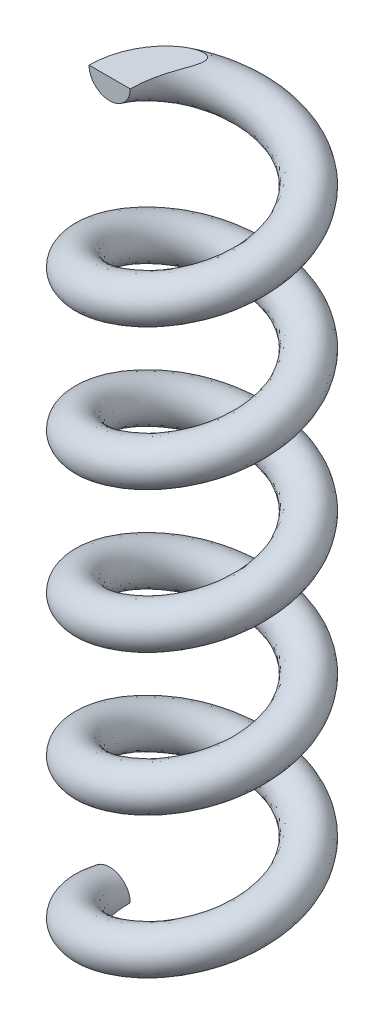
ISO-10303-21;
HEADER;
FILE_DESCRIPTION(('STEP AP214'),'2;1');
FILE_NAME('part.step','',(''),(''),'','','');
FILE_SCHEMA(('AUTOMOTIVE_DESIGN { 1 0 10303 214 1 1 1 1 }'));
ENDSEC;
DATA;
#1=APPLICATION_CONTEXT('core data for automotive mechanical design processes');
#2=APPLICATION_PROTOCOL_DEFINITION('international standard','automotive_design',2000,#1);
#3=PRODUCT_CONTEXT('',#1,'mechanical');
#4=PRODUCT('Part','Part','',(#3));
#5=PRODUCT_RELATED_PRODUCT_CATEGORY('part','',(#4));
#6=PRODUCT_DEFINITION_FORMATION('','',#4);
#7=PRODUCT_DEFINITION_CONTEXT('part definition',#1,'design');
#8=PRODUCT_DEFINITION('design','',#6,#7);
#9=PRODUCT_DEFINITION_SHAPE('','',#8);
#10=(LENGTH_UNIT() NAMED_UNIT(*) SI_UNIT(.MILLI.,.METRE.));
#11=(NAMED_UNIT(*) PLANE_ANGLE_UNIT() SI_UNIT($,.RADIAN.));
#12=(NAMED_UNIT(*) SI_UNIT($,.STERADIAN.) SOLID_ANGLE_UNIT());
#13=UNCERTAINTY_MEASURE_WITH_UNIT(LENGTH_MEASURE(1.E-05),#10,'distance_accuracy_value','');
#14=(GEOMETRIC_REPRESENTATION_CONTEXT(3) GLOBAL_UNCERTAINTY_ASSIGNED_CONTEXT((#13)) GLOBAL_UNIT_ASSIGNED_CONTEXT((#10,
#11,#12)) REPRESENTATION_CONTEXT('',''));
#15=CARTESIAN_POINT('',(0.,0.,0.));
#16=DIRECTION('',(0.,0.,1.));
#17=DIRECTION('',(1.,0.,0.));
#18=AXIS2_PLACEMENT_3D('',#15,#16,#17);
#19=CARTESIAN_POINT('',(-38.,48.323739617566,9.77614774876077E-13));
#20=DIRECTION('',(0.,0.,1.));
#21=DIRECTION('',(1.,0.,0.));
#22=AXIS2_PLACEMENT_3D('',#19,#20,#21);
#23=PLANE('',#22);
#24=CARTESIAN_POINT('',(-38.,48.323739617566,9.77614774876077E-13));
#25=DIRECTION('',(0.,0.,1.));
#26=DIRECTION('',(1.,0.,0.));
#27=AXIS2_PLACEMENT_3D('',#24,#25,#26);
#28=CIRCLE('',#27,3.5);
#29=CARTESIAN_POINT('',(-41.5,48.3237391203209,0.));
#30=VERTEX_POINT('',#29);
#31=CARTESIAN_POINT('',(-34.5,48.3237391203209,7.3321108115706E-13));
#32=VERTEX_POINT('',#31);
#33=EDGE_CURVE('E71',#30,#32,#28,.T.);
#34=ORIENTED_EDGE('',*,*,#33,.T.);
#35=DIRECTION('',(-1.,0.,0.));
#36=VECTOR('',#35,1.);
#37=CARTESIAN_POINT('',(-38.,48.3237391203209,9.77614774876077E-13));
#38=LINE('',#37,#36);
#39=EDGE_CURVE('E63',#32,#30,#38,.T.);
#40=ORIENTED_EDGE('',*,*,#39,.T.);
#41=EDGE_LOOP('',(#34,#40));
#42=FACE_BOUND('',#41,.T.);
#43=ADVANCED_FACE('F41',(#42),#23,.T.);
#44=CARTESIAN_POINT('',(-34.5,-71.5,0.));
#45=CARTESIAN_POINT('',(-34.5,-70.3017626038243,3.41165681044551));
#46=CARTESIAN_POINT('',(-32.4946784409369,-69.1035252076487,6.17174514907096));
#47=CARTESIAN_POINT('',(-30.4893568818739,-67.905287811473,8.93183348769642));
#48=CARTESIAN_POINT('',(-27.2446784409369,-66.7070504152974,9.98609342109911));
#49=CARTESIAN_POINT('',(-24.,-65.5088130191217,11.0403533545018));
#50=CARTESIAN_POINT('',(-20.7553215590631,-64.310575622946,9.98609342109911));
#51=CARTESIAN_POINT('',(-17.5106431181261,-63.1123382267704,8.93183348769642));
#52=CARTESIAN_POINT('',(-15.5053215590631,-61.9141008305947,6.17174514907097));
#53=CARTESIAN_POINT('',(-13.5,-60.7158634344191,3.41165681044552));
#54=CARTESIAN_POINT('',(-13.5,-59.5176260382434,0.));
#55=CARTESIAN_POINT('',(-13.5,-58.3193886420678,-3.41165681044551));
#56=CARTESIAN_POINT('',(-15.5053215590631,-57.1211512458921,-6.17174514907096));
#57=CARTESIAN_POINT('',(-17.5106431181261,-55.9229138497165,-8.93183348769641));
#58=CARTESIAN_POINT('',(-20.7553215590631,-54.7246764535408,-9.98609342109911));
#59=CARTESIAN_POINT('',(-24.,-53.5264390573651,-11.0403533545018));
#60=CARTESIAN_POINT('',(-27.2446784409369,-52.3282016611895,-9.98609342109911));
#61=CARTESIAN_POINT('',(-30.4893568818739,-51.1299642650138,-8.93183348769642));
#62=CARTESIAN_POINT('',(-32.4946784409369,-49.9317268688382,-6.17174514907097));
#63=CARTESIAN_POINT('',(-34.5,-48.7334894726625,-3.41165681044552));
#64=CARTESIAN_POINT('',(-34.5,-47.5352520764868,0.));
#65=CARTESIAN_POINT('',(-34.5,-46.3370146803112,3.41165681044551));
#66=CARTESIAN_POINT('',(-32.4946784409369,-45.1387772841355,6.17174514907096));
#67=CARTESIAN_POINT('',(-30.4893568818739,-43.9405398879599,8.93183348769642));
#68=CARTESIAN_POINT('',(-27.2446784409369,-42.7423024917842,9.98609342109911));
#69=CARTESIAN_POINT('',(-24.,-41.5440650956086,11.0403533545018));
#70=CARTESIAN_POINT('',(-20.7553215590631,-40.3458276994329,9.98609342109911));
#71=CARTESIAN_POINT('',(-17.5106431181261,-39.1475903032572,8.93183348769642));
#72=CARTESIAN_POINT('',(-15.5053215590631,-37.9493529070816,6.17174514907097));
#73=CARTESIAN_POINT('',(-13.5,-36.7511155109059,3.41165681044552));
#74=CARTESIAN_POINT('',(-13.5,-35.5528781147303,0.));
#75=CARTESIAN_POINT('',(-13.5,-34.3546407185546,-3.41165681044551));
#76=CARTESIAN_POINT('',(-15.5053215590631,-33.156403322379,-6.17174514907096));
#77=CARTESIAN_POINT('',(-17.5106431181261,-31.9581659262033,-8.93183348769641));
#78=CARTESIAN_POINT('',(-20.7553215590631,-30.7599285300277,-9.98609342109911));
#79=CARTESIAN_POINT('',(-24.,-29.561691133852,-11.0403533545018));
#80=CARTESIAN_POINT('',(-27.2446784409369,-28.3634537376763,-9.98609342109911));
#81=CARTESIAN_POINT('',(-30.4893568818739,-27.1652163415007,-8.93183348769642));
#82=CARTESIAN_POINT('',(-32.4946784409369,-25.966978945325,-6.17174514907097));
#83=CARTESIAN_POINT('',(-34.5,-24.7687415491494,-3.41165681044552));
#84=CARTESIAN_POINT('',(-34.5,-23.5705041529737,0.));
#85=CARTESIAN_POINT('',(-34.5,-22.372266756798,3.41165681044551));
#86=CARTESIAN_POINT('',(-32.4946784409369,-21.1740293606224,6.17174514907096));
#87=CARTESIAN_POINT('',(-30.4893568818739,-19.9757919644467,8.93183348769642));
#88=CARTESIAN_POINT('',(-27.2446784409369,-18.7775545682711,9.98609342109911));
#89=CARTESIAN_POINT('',(-24.,-17.5793171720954,11.0403533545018));
#90=CARTESIAN_POINT('',(-20.7553215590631,-16.3810797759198,9.98609342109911));
#91=CARTESIAN_POINT('',(-17.5106431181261,-15.1828423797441,8.93183348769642));
#92=CARTESIAN_POINT('',(-15.5053215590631,-13.9846049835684,6.17174514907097));
#93=CARTESIAN_POINT('',(-13.5,-12.7863675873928,3.41165681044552));
#94=CARTESIAN_POINT('',(-13.5,-11.5881301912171,0.));
#95=CARTESIAN_POINT('',(-13.5,-10.3898927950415,-3.41165681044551));
#96=CARTESIAN_POINT('',(-15.5053215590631,-9.19165539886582,-6.17174514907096));
#97=CARTESIAN_POINT('',(-17.5106431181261,-7.99341800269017,-8.93183348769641));
#98=CARTESIAN_POINT('',(-20.7553215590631,-6.7951806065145,-9.98609342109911));
#99=CARTESIAN_POINT('',(-24.,-5.59694321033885,-11.0403533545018));
#100=CARTESIAN_POINT('',(-27.2446784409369,-4.3987058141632,-9.98609342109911));
#101=CARTESIAN_POINT('',(-30.4893568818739,-3.20046841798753,-8.93183348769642));
#102=CARTESIAN_POINT('',(-32.4946784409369,-2.00223102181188,-6.17174514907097));
#103=CARTESIAN_POINT('',(-34.5,-0.803993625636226,-3.41165681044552));
#104=CARTESIAN_POINT('',(-34.5,0.39424377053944,0.));
#105=CARTESIAN_POINT('',(-34.5,1.59248116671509,3.41165681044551));
#106=CARTESIAN_POINT('',(-32.4946784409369,2.79071856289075,6.17174514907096));
#107=CARTESIAN_POINT('',(-30.4893568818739,3.98895595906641,8.93183348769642));
#108=CARTESIAN_POINT('',(-27.2446784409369,5.18719335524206,9.98609342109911));
#109=CARTESIAN_POINT('',(-24.,6.38543075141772,11.0403533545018));
#110=CARTESIAN_POINT('',(-20.7553215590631,7.58366814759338,9.98609342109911));
#111=CARTESIAN_POINT('',(-17.5106431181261,8.78190554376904,8.93183348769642));
#112=CARTESIAN_POINT('',(-15.5053215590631,9.98014293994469,6.17174514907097));
#113=CARTESIAN_POINT('',(-13.5,11.1783803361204,3.41165681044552));
#114=CARTESIAN_POINT('',(-13.5,12.376617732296,0.));
#115=CARTESIAN_POINT('',(-13.5,13.5748551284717,-3.41165681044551));
#116=CARTESIAN_POINT('',(-15.5053215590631,14.7730925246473,-6.17174514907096));
#117=CARTESIAN_POINT('',(-17.5106431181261,15.971329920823,-8.93183348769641));
#118=CARTESIAN_POINT('',(-20.7553215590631,17.1695673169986,-9.98609342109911));
#119=CARTESIAN_POINT('',(-24.,18.3678047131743,-11.0403533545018));
#120=CARTESIAN_POINT('',(-27.2446784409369,19.56604210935,-9.98609342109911));
#121=CARTESIAN_POINT('',(-30.4893568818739,20.7642795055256,-8.93183348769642));
#122=CARTESIAN_POINT('',(-32.4946784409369,21.9625169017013,-6.17174514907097));
#123=CARTESIAN_POINT('',(-34.5,23.1607542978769,-3.41165681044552));
#124=CARTESIAN_POINT('',(-34.5,24.3589916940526,0.));
#125=CARTESIAN_POINT('',(-34.5,25.5572290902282,3.41165681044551));
#126=CARTESIAN_POINT('',(-32.4946784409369,26.7554664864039,6.17174514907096));
#127=CARTESIAN_POINT('',(-30.4893568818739,27.9537038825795,8.93183348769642));
#128=CARTESIAN_POINT('',(-27.2446784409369,29.1519412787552,9.98609342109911));
#129=CARTESIAN_POINT('',(-24.,30.3501786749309,11.0403533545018));
#130=CARTESIAN_POINT('',(-20.7553215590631,31.5484160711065,9.98609342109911));
#131=CARTESIAN_POINT('',(-17.5106431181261,32.7466534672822,8.93183348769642));
#132=CARTESIAN_POINT('',(-15.5053215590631,33.9448908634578,6.17174514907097));
#133=CARTESIAN_POINT('',(-13.5,35.1431282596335,3.41165681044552));
#134=CARTESIAN_POINT('',(-13.5,36.3413656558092,0.));
#135=CARTESIAN_POINT('',(-13.5,37.5396030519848,-3.41165681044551));
#136=CARTESIAN_POINT('',(-15.5053215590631,38.7378404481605,-6.17174514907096));
#137=CARTESIAN_POINT('',(-17.5106431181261,39.9360778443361,-8.93183348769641));
#138=CARTESIAN_POINT('',(-20.7553215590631,41.1343152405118,-9.98609342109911));
#139=CARTESIAN_POINT('',(-24.,42.3325526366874,-11.0403533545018));
#140=CARTESIAN_POINT('',(-27.2446784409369,43.5307900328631,-9.98609342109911));
#141=CARTESIAN_POINT('',(-30.4893568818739,44.7290274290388,-8.93183348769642));
#142=CARTESIAN_POINT('',(-32.4946784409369,45.9272648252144,-6.17174514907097));
#143=CARTESIAN_POINT('',(-34.5,47.1255022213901,-3.41165681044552));
#144=CARTESIAN_POINT('',(-34.5,48.3237396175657,0.));
#145=CARTESIAN_POINT('',(-34.5,-64.5,0.));
#146=CARTESIAN_POINT('',(-34.5,-63.3017626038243,3.41165681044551));
#147=CARTESIAN_POINT('',(-32.4946784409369,-62.1035252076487,6.17174514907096));
#148=CARTESIAN_POINT('',(-30.4893568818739,-60.905287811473,8.93183348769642));
#149=CARTESIAN_POINT('',(-27.2446784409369,-59.7070504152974,9.98609342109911));
#150=CARTESIAN_POINT('',(-24.,-58.5088130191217,11.0403533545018));
#151=CARTESIAN_POINT('',(-20.7553215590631,-57.310575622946,9.98609342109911));
#152=CARTESIAN_POINT('',(-17.5106431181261,-56.1123382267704,8.93183348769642));
#153=CARTESIAN_POINT('',(-15.5053215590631,-54.9141008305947,6.17174514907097));
#154=CARTESIAN_POINT('',(-13.5,-53.7158634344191,3.41165681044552));
#155=CARTESIAN_POINT('',(-13.5,-52.5176260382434,0.));
#156=CARTESIAN_POINT('',(-13.5,-51.3193886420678,-3.41165681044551));
#157=CARTESIAN_POINT('',(-15.5053215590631,-50.1211512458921,-6.17174514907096));
#158=CARTESIAN_POINT('',(-17.5106431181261,-48.9229138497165,-8.93183348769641));
#159=CARTESIAN_POINT('',(-20.7553215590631,-47.7246764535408,-9.98609342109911));
#160=CARTESIAN_POINT('',(-24.,-46.5264390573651,-11.0403533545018));
#161=CARTESIAN_POINT('',(-27.2446784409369,-45.3282016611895,-9.98609342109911));
#162=CARTESIAN_POINT('',(-30.4893568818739,-44.1299642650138,-8.93183348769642));
#163=CARTESIAN_POINT('',(-32.4946784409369,-42.9317268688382,-6.17174514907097));
#164=CARTESIAN_POINT('',(-34.5,-41.7334894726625,-3.41165681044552));
#165=CARTESIAN_POINT('',(-34.5,-40.5352520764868,0.));
#166=CARTESIAN_POINT('',(-34.5,-39.3370146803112,3.41165681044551));
#167=CARTESIAN_POINT('',(-32.4946784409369,-38.1387772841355,6.17174514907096));
#168=CARTESIAN_POINT('',(-30.4893568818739,-36.9405398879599,8.93183348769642));
#169=CARTESIAN_POINT('',(-27.2446784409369,-35.7423024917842,9.98609342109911));
#170=CARTESIAN_POINT('',(-24.,-34.5440650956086,11.0403533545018));
#171=CARTESIAN_POINT('',(-20.7553215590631,-33.3458276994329,9.98609342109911));
#172=CARTESIAN_POINT('',(-17.5106431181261,-32.1475903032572,8.93183348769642));
#173=CARTESIAN_POINT('',(-15.5053215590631,-30.9493529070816,6.17174514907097));
#174=CARTESIAN_POINT('',(-13.5,-29.7511155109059,3.41165681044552));
#175=CARTESIAN_POINT('',(-13.5,-28.5528781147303,0.));
#176=CARTESIAN_POINT('',(-13.5,-27.3546407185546,-3.41165681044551));
#177=CARTESIAN_POINT('',(-15.5053215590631,-26.156403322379,-6.17174514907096));
#178=CARTESIAN_POINT('',(-17.5106431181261,-24.9581659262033,-8.93183348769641));
#179=CARTESIAN_POINT('',(-20.7553215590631,-23.7599285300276,-9.98609342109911));
#180=CARTESIAN_POINT('',(-24.,-22.561691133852,-11.0403533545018));
#181=CARTESIAN_POINT('',(-27.2446784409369,-21.3634537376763,-9.98609342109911));
#182=CARTESIAN_POINT('',(-30.4893568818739,-20.1652163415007,-8.93183348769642));
#183=CARTESIAN_POINT('',(-32.4946784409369,-18.966978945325,-6.17174514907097));
#184=CARTESIAN_POINT('',(-34.5,-17.7687415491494,-3.41165681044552));
#185=CARTESIAN_POINT('',(-34.5,-16.5705041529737,0.));
#186=CARTESIAN_POINT('',(-34.5,-15.372266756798,3.41165681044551));
#187=CARTESIAN_POINT('',(-32.4946784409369,-14.1740293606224,6.17174514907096));
#188=CARTESIAN_POINT('',(-30.4893568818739,-12.9757919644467,8.93183348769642));
#189=CARTESIAN_POINT('',(-27.2446784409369,-11.7775545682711,9.98609342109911));
#190=CARTESIAN_POINT('',(-24.,-10.5793171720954,11.0403533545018));
#191=CARTESIAN_POINT('',(-20.7553215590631,-9.38107977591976,9.98609342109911));
#192=CARTESIAN_POINT('',(-17.5106431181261,-8.1828423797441,8.93183348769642));
#193=CARTESIAN_POINT('',(-15.5053215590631,-6.98460498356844,6.17174514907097));
#194=CARTESIAN_POINT('',(-13.5,-5.78636758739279,3.41165681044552));
#195=CARTESIAN_POINT('',(-13.5,-4.58813019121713,0.));
#196=CARTESIAN_POINT('',(-13.5,-3.38989279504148,-3.41165681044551));
#197=CARTESIAN_POINT('',(-15.5053215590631,-2.19165539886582,-6.17174514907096));
#198=CARTESIAN_POINT('',(-17.5106431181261,-0.993418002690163,-8.93183348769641));
#199=CARTESIAN_POINT('',(-20.7553215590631,0.204819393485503,-9.98609342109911));
#200=CARTESIAN_POINT('',(-24.,1.40305678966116,-11.0403533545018));
#201=CARTESIAN_POINT('',(-27.2446784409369,2.60129418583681,-9.98609342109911));
#202=CARTESIAN_POINT('',(-30.4893568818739,3.79953158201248,-8.93183348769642));
#203=CARTESIAN_POINT('',(-32.4946784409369,4.99776897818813,-6.17174514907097));
#204=CARTESIAN_POINT('',(-34.5,6.19600637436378,-3.41165681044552));
#205=CARTESIAN_POINT('',(-34.5,7.39424377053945,0.));
#206=CARTESIAN_POINT('',(-34.5,8.5924811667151,3.41165681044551));
#207=CARTESIAN_POINT('',(-32.4946784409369,9.79071856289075,6.17174514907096));
#208=CARTESIAN_POINT('',(-30.4893568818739,10.9889559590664,8.93183348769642));
#209=CARTESIAN_POINT('',(-27.2446784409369,12.1871933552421,9.98609342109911));
#210=CARTESIAN_POINT('',(-24.,13.3854307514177,11.0403533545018));
#211=CARTESIAN_POINT('',(-20.7553215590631,14.5836681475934,9.98609342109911));
#212=CARTESIAN_POINT('',(-17.5106431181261,15.781905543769,8.93183348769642));
#213=CARTESIAN_POINT('',(-15.5053215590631,16.9801429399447,6.17174514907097));
#214=CARTESIAN_POINT('',(-13.5,18.1783803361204,3.41165681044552));
#215=CARTESIAN_POINT('',(-13.5,19.376617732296,0.));
#216=CARTESIAN_POINT('',(-13.5,20.5748551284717,-3.41165681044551));
#217=CARTESIAN_POINT('',(-15.5053215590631,21.7730925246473,-6.17174514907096));
#218=CARTESIAN_POINT('',(-17.5106431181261,22.971329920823,-8.93183348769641));
#219=CARTESIAN_POINT('',(-20.7553215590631,24.1695673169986,-9.98609342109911));
#220=CARTESIAN_POINT('',(-24.,25.3678047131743,-11.0403533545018));
#221=CARTESIAN_POINT('',(-27.2446784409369,26.56604210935,-9.98609342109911));
#222=CARTESIAN_POINT('',(-30.4893568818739,27.7642795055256,-8.93183348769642));
#223=CARTESIAN_POINT('',(-32.4946784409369,28.9625169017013,-6.17174514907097));
#224=CARTESIAN_POINT('',(-34.5,30.1607542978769,-3.41165681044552));
#225=CARTESIAN_POINT('',(-34.5,31.3589916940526,0.));
#226=CARTESIAN_POINT('',(-34.5,32.5572290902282,3.41165681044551));
#227=CARTESIAN_POINT('',(-32.4946784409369,33.7554664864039,6.17174514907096));
#228=CARTESIAN_POINT('',(-30.4893568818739,34.9537038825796,8.93183348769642));
#229=CARTESIAN_POINT('',(-27.2446784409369,36.1519412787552,9.98609342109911));
#230=CARTESIAN_POINT('',(-24.,37.3501786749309,11.0403533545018));
#231=CARTESIAN_POINT('',(-20.7553215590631,38.5484160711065,9.98609342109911));
#232=CARTESIAN_POINT('',(-17.5106431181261,39.7466534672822,8.93183348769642));
#233=CARTESIAN_POINT('',(-15.5053215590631,40.9448908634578,6.17174514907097));
#234=CARTESIAN_POINT('',(-13.5,42.1431282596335,3.41165681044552));
#235=CARTESIAN_POINT('',(-13.5,43.3413656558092,0.));
#236=CARTESIAN_POINT('',(-13.5,44.5396030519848,-3.41165681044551));
#237=CARTESIAN_POINT('',(-15.5053215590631,45.7378404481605,-6.17174514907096));
#238=CARTESIAN_POINT('',(-17.5106431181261,46.9360778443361,-8.93183348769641));
#239=CARTESIAN_POINT('',(-20.7553215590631,48.1343152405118,-9.98609342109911));
#240=CARTESIAN_POINT('',(-24.,49.3325526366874,-11.0403533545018));
#241=CARTESIAN_POINT('',(-27.2446784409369,50.5307900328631,-9.98609342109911));
#242=CARTESIAN_POINT('',(-30.4893568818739,51.7290274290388,-8.93183348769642));
#243=CARTESIAN_POINT('',(-32.4946784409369,52.9272648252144,-6.17174514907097));
#244=CARTESIAN_POINT('',(-34.5,54.1255022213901,-3.41165681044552));
#245=CARTESIAN_POINT('',(-34.5,55.3237396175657,0.));
#246=CARTESIAN_POINT('',(-41.5,-64.5,0.));
#247=CARTESIAN_POINT('',(-41.5,-63.3017626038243,5.68609468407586));
#248=CARTESIAN_POINT('',(-38.1577974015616,-62.1035252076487,10.2862419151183));
#249=CARTESIAN_POINT('',(-34.8155948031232,-60.905287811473,14.8863891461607));
#250=CARTESIAN_POINT('',(-29.4077974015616,-59.7070504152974,16.6434890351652));
#251=CARTESIAN_POINT('',(-24.,-58.5088130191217,18.4005889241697));
#252=CARTESIAN_POINT('',(-18.5922025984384,-57.310575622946,16.6434890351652));
#253=CARTESIAN_POINT('',(-13.1844051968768,-56.1123382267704,14.8863891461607));
#254=CARTESIAN_POINT('',(-9.84220259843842,-54.9141008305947,10.2862419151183));
#255=CARTESIAN_POINT('',(-6.5,-53.7158634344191,5.68609468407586));
#256=CARTESIAN_POINT('',(-6.5,-52.5176260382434,0.));
#257=CARTESIAN_POINT('',(-6.5,-51.3193886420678,-5.68609468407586));
#258=CARTESIAN_POINT('',(-9.84220259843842,-50.1211512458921,-10.2862419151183));
#259=CARTESIAN_POINT('',(-13.1844051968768,-48.9229138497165,-14.8863891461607));
#260=CARTESIAN_POINT('',(-18.5922025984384,-47.7246764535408,-16.6434890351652));
#261=CARTESIAN_POINT('',(-24.,-46.5264390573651,-18.4005889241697));
#262=CARTESIAN_POINT('',(-29.4077974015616,-45.3282016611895,-16.6434890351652));
#263=CARTESIAN_POINT('',(-34.8155948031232,-44.1299642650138,-14.8863891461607));
#264=CARTESIAN_POINT('',(-38.1577974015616,-42.9317268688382,-10.2862419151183));
#265=CARTESIAN_POINT('',(-41.5,-41.7334894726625,-5.68609468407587));
#266=CARTESIAN_POINT('',(-41.5,-40.5352520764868,0.));
#267=CARTESIAN_POINT('',(-41.5,-39.3370146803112,5.68609468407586));
#268=CARTESIAN_POINT('',(-38.1577974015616,-38.1387772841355,10.2862419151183));
#269=CARTESIAN_POINT('',(-34.8155948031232,-36.9405398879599,14.8863891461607));
#270=CARTESIAN_POINT('',(-29.4077974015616,-35.7423024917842,16.6434890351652));
#271=CARTESIAN_POINT('',(-24.,-34.5440650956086,18.4005889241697));
#272=CARTESIAN_POINT('',(-18.5922025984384,-33.3458276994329,16.6434890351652));
#273=CARTESIAN_POINT('',(-13.1844051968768,-32.1475903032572,14.8863891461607));
#274=CARTESIAN_POINT('',(-9.84220259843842,-30.9493529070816,10.2862419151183));
#275=CARTESIAN_POINT('',(-6.5,-29.7511155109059,5.68609468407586));
#276=CARTESIAN_POINT('',(-6.5,-28.5528781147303,0.));
#277=CARTESIAN_POINT('',(-6.5,-27.3546407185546,-5.68609468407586));
#278=CARTESIAN_POINT('',(-9.84220259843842,-26.156403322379,-10.2862419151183));
#279=CARTESIAN_POINT('',(-13.1844051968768,-24.9581659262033,-14.8863891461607));
#280=CARTESIAN_POINT('',(-18.5922025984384,-23.7599285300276,-16.6434890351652));
#281=CARTESIAN_POINT('',(-24.,-22.561691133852,-18.4005889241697));
#282=CARTESIAN_POINT('',(-29.4077974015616,-21.3634537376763,-16.6434890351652));
#283=CARTESIAN_POINT('',(-34.8155948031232,-20.1652163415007,-14.8863891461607));
#284=CARTESIAN_POINT('',(-38.1577974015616,-18.966978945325,-10.2862419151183));
#285=CARTESIAN_POINT('',(-41.5,-17.7687415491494,-5.68609468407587));
#286=CARTESIAN_POINT('',(-41.5,-16.5705041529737,0.));
#287=CARTESIAN_POINT('',(-41.5,-15.372266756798,5.68609468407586));
#288=CARTESIAN_POINT('',(-38.1577974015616,-14.1740293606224,10.2862419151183));
#289=CARTESIAN_POINT('',(-34.8155948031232,-12.9757919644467,14.8863891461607));
#290=CARTESIAN_POINT('',(-29.4077974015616,-11.7775545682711,16.6434890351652));
#291=CARTESIAN_POINT('',(-24.,-10.5793171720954,18.4005889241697));
#292=CARTESIAN_POINT('',(-18.5922025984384,-9.38107977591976,16.6434890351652));
#293=CARTESIAN_POINT('',(-13.1844051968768,-8.1828423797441,14.8863891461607));
#294=CARTESIAN_POINT('',(-9.84220259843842,-6.98460498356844,10.2862419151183));
#295=CARTESIAN_POINT('',(-6.5,-5.78636758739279,5.68609468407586));
#296=CARTESIAN_POINT('',(-6.5,-4.58813019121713,0.));
#297=CARTESIAN_POINT('',(-6.5,-3.38989279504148,-5.68609468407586));
#298=CARTESIAN_POINT('',(-9.84220259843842,-2.19165539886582,-10.2862419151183));
#299=CARTESIAN_POINT('',(-13.1844051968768,-0.993418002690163,-14.8863891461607));
#300=CARTESIAN_POINT('',(-18.5922025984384,0.204819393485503,-16.6434890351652));
#301=CARTESIAN_POINT('',(-24.,1.40305678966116,-18.4005889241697));
#302=CARTESIAN_POINT('',(-29.4077974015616,2.60129418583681,-16.6434890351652));
#303=CARTESIAN_POINT('',(-34.8155948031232,3.79953158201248,-14.8863891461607));
#304=CARTESIAN_POINT('',(-38.1577974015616,4.99776897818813,-10.2862419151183));
#305=CARTESIAN_POINT('',(-41.5,6.19600637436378,-5.68609468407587));
#306=CARTESIAN_POINT('',(-41.5,7.39424377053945,0.));
#307=CARTESIAN_POINT('',(-41.5,8.5924811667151,5.68609468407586));
#308=CARTESIAN_POINT('',(-38.1577974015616,9.79071856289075,10.2862419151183));
#309=CARTESIAN_POINT('',(-34.8155948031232,10.9889559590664,14.8863891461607));
#310=CARTESIAN_POINT('',(-29.4077974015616,12.1871933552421,16.6434890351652));
#311=CARTESIAN_POINT('',(-24.,13.3854307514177,18.4005889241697));
#312=CARTESIAN_POINT('',(-18.5922025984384,14.5836681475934,16.6434890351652));
#313=CARTESIAN_POINT('',(-13.1844051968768,15.781905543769,14.8863891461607));
#314=CARTESIAN_POINT('',(-9.84220259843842,16.9801429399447,10.2862419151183));
#315=CARTESIAN_POINT('',(-6.5,18.1783803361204,5.68609468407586));
#316=CARTESIAN_POINT('',(-6.5,19.376617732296,0.));
#317=CARTESIAN_POINT('',(-6.5,20.5748551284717,-5.68609468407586));
#318=CARTESIAN_POINT('',(-9.84220259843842,21.7730925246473,-10.2862419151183));
#319=CARTESIAN_POINT('',(-13.1844051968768,22.971329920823,-14.8863891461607));
#320=CARTESIAN_POINT('',(-18.5922025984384,24.1695673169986,-16.6434890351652));
#321=CARTESIAN_POINT('',(-24.,25.3678047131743,-18.4005889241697));
#322=CARTESIAN_POINT('',(-29.4077974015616,26.56604210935,-16.6434890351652));
#323=CARTESIAN_POINT('',(-34.8155948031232,27.7642795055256,-14.8863891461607));
#324=CARTESIAN_POINT('',(-38.1577974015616,28.9625169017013,-10.2862419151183));
#325=CARTESIAN_POINT('',(-41.5,30.1607542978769,-5.68609468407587));
#326=CARTESIAN_POINT('',(-41.5,31.3589916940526,0.));
#327=CARTESIAN_POINT('',(-41.5,32.5572290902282,5.68609468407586));
#328=CARTESIAN_POINT('',(-38.1577974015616,33.7554664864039,10.2862419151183));
#329=CARTESIAN_POINT('',(-34.8155948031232,34.9537038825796,14.8863891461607));
#330=CARTESIAN_POINT('',(-29.4077974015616,36.1519412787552,16.6434890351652));
#331=CARTESIAN_POINT('',(-24.,37.3501786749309,18.4005889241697));
#332=CARTESIAN_POINT('',(-18.5922025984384,38.5484160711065,16.6434890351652));
#333=CARTESIAN_POINT('',(-13.1844051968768,39.7466534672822,14.8863891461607));
#334=CARTESIAN_POINT('',(-9.84220259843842,40.9448908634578,10.2862419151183));
#335=CARTESIAN_POINT('',(-6.5,42.1431282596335,5.68609468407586));
#336=CARTESIAN_POINT('',(-6.5,43.3413656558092,0.));
#337=CARTESIAN_POINT('',(-6.5,44.5396030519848,-5.68609468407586));
#338=CARTESIAN_POINT('',(-9.84220259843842,45.7378404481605,-10.2862419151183));
#339=CARTESIAN_POINT('',(-13.1844051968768,46.9360778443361,-14.8863891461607));
#340=CARTESIAN_POINT('',(-18.5922025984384,48.1343152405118,-16.6434890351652));
#341=CARTESIAN_POINT('',(-24.,49.3325526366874,-18.4005889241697));
#342=CARTESIAN_POINT('',(-29.4077974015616,50.5307900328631,-16.6434890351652));
#343=CARTESIAN_POINT('',(-34.8155948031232,51.7290274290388,-14.8863891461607));
#344=CARTESIAN_POINT('',(-38.1577974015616,52.9272648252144,-10.2862419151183));
#345=CARTESIAN_POINT('',(-41.5,54.1255022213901,-5.68609468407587));
#346=CARTESIAN_POINT('',(-41.5,55.3237396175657,0.));
#347=CARTESIAN_POINT('',(-41.5,-71.5,0.));
#348=CARTESIAN_POINT('',(-41.5,-70.3017626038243,5.68609468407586));
#349=CARTESIAN_POINT('',(-38.1577974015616,-69.1035252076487,10.2862419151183));
#350=CARTESIAN_POINT('',(-34.8155948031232,-67.905287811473,14.8863891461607));
#351=CARTESIAN_POINT('',(-29.4077974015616,-66.7070504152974,16.6434890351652));
#352=CARTESIAN_POINT('',(-24.,-65.5088130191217,18.4005889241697));
#353=CARTESIAN_POINT('',(-18.5922025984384,-64.310575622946,16.6434890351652));
#354=CARTESIAN_POINT('',(-13.1844051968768,-63.1123382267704,14.8863891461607));
#355=CARTESIAN_POINT('',(-9.84220259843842,-61.9141008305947,10.2862419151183));
#356=CARTESIAN_POINT('',(-6.5,-60.7158634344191,5.68609468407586));
#357=CARTESIAN_POINT('',(-6.5,-59.5176260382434,0.));
#358=CARTESIAN_POINT('',(-6.5,-58.3193886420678,-5.68609468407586));
#359=CARTESIAN_POINT('',(-9.84220259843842,-57.1211512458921,-10.2862419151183));
#360=CARTESIAN_POINT('',(-13.1844051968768,-55.9229138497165,-14.8863891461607));
#361=CARTESIAN_POINT('',(-18.5922025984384,-54.7246764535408,-16.6434890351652));
#362=CARTESIAN_POINT('',(-24.,-53.5264390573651,-18.4005889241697));
#363=CARTESIAN_POINT('',(-29.4077974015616,-52.3282016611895,-16.6434890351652));
#364=CARTESIAN_POINT('',(-34.8155948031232,-51.1299642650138,-14.8863891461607));
#365=CARTESIAN_POINT('',(-38.1577974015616,-49.9317268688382,-10.2862419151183));
#366=CARTESIAN_POINT('',(-41.5,-48.7334894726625,-5.68609468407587));
#367=CARTESIAN_POINT('',(-41.5,-47.5352520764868,0.));
#368=CARTESIAN_POINT('',(-41.5,-46.3370146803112,5.68609468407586));
#369=CARTESIAN_POINT('',(-38.1577974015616,-45.1387772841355,10.2862419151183));
#370=CARTESIAN_POINT('',(-34.8155948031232,-43.9405398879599,14.8863891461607));
#371=CARTESIAN_POINT('',(-29.4077974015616,-42.7423024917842,16.6434890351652));
#372=CARTESIAN_POINT('',(-24.,-41.5440650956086,18.4005889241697));
#373=CARTESIAN_POINT('',(-18.5922025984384,-40.3458276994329,16.6434890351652));
#374=CARTESIAN_POINT('',(-13.1844051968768,-39.1475903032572,14.8863891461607));
#375=CARTESIAN_POINT('',(-9.84220259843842,-37.9493529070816,10.2862419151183));
#376=CARTESIAN_POINT('',(-6.5,-36.7511155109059,5.68609468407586));
#377=CARTESIAN_POINT('',(-6.5,-35.5528781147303,0.));
#378=CARTESIAN_POINT('',(-6.5,-34.3546407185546,-5.68609468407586));
#379=CARTESIAN_POINT('',(-9.84220259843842,-33.156403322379,-10.2862419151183));
#380=CARTESIAN_POINT('',(-13.1844051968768,-31.9581659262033,-14.8863891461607));
#381=CARTESIAN_POINT('',(-18.5922025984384,-30.7599285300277,-16.6434890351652));
#382=CARTESIAN_POINT('',(-24.,-29.561691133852,-18.4005889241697));
#383=CARTESIAN_POINT('',(-29.4077974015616,-28.3634537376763,-16.6434890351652));
#384=CARTESIAN_POINT('',(-34.8155948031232,-27.1652163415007,-14.8863891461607));
#385=CARTESIAN_POINT('',(-38.1577974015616,-25.966978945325,-10.2862419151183));
#386=CARTESIAN_POINT('',(-41.5,-24.7687415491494,-5.68609468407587));
#387=CARTESIAN_POINT('',(-41.5,-23.5705041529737,0.));
#388=CARTESIAN_POINT('',(-41.5,-22.372266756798,5.68609468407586));
#389=CARTESIAN_POINT('',(-38.1577974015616,-21.1740293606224,10.2862419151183));
#390=CARTESIAN_POINT('',(-34.8155948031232,-19.9757919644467,14.8863891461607));
#391=CARTESIAN_POINT('',(-29.4077974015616,-18.7775545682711,16.6434890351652));
#392=CARTESIAN_POINT('',(-24.,-17.5793171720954,18.4005889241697));
#393=CARTESIAN_POINT('',(-18.5922025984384,-16.3810797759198,16.6434890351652));
#394=CARTESIAN_POINT('',(-13.1844051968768,-15.1828423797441,14.8863891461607));
#395=CARTESIAN_POINT('',(-9.84220259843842,-13.9846049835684,10.2862419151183));
#396=CARTESIAN_POINT('',(-6.5,-12.7863675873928,5.68609468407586));
#397=CARTESIAN_POINT('',(-6.5,-11.5881301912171,0.));
#398=CARTESIAN_POINT('',(-6.5,-10.3898927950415,-5.68609468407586));
#399=CARTESIAN_POINT('',(-9.84220259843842,-9.19165539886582,-10.2862419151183));
#400=CARTESIAN_POINT('',(-13.1844051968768,-7.99341800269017,-14.8863891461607));
#401=CARTESIAN_POINT('',(-18.5922025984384,-6.7951806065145,-16.6434890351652));
#402=CARTESIAN_POINT('',(-24.,-5.59694321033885,-18.4005889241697));
#403=CARTESIAN_POINT('',(-29.4077974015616,-4.3987058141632,-16.6434890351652));
#404=CARTESIAN_POINT('',(-34.8155948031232,-3.20046841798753,-14.8863891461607));
#405=CARTESIAN_POINT('',(-38.1577974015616,-2.00223102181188,-10.2862419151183));
#406=CARTESIAN_POINT('',(-41.5,-0.803993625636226,-5.68609468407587));
#407=CARTESIAN_POINT('',(-41.5,0.39424377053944,0.));
#408=CARTESIAN_POINT('',(-41.5,1.59248116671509,5.68609468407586));
#409=CARTESIAN_POINT('',(-38.1577974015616,2.79071856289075,10.2862419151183));
#410=CARTESIAN_POINT('',(-34.8155948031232,3.98895595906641,14.8863891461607));
#411=CARTESIAN_POINT('',(-29.4077974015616,5.18719335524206,16.6434890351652));
#412=CARTESIAN_POINT('',(-24.,6.38543075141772,18.4005889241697));
#413=CARTESIAN_POINT('',(-18.5922025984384,7.58366814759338,16.6434890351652));
#414=CARTESIAN_POINT('',(-13.1844051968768,8.78190554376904,14.8863891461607));
#415=CARTESIAN_POINT('',(-9.84220259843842,9.98014293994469,10.2862419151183));
#416=CARTESIAN_POINT('',(-6.5,11.1783803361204,5.68609468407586));
#417=CARTESIAN_POINT('',(-6.5,12.376617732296,0.));
#418=CARTESIAN_POINT('',(-6.5,13.5748551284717,-5.68609468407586));
#419=CARTESIAN_POINT('',(-9.84220259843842,14.7730925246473,-10.2862419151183));
#420=CARTESIAN_POINT('',(-13.1844051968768,15.971329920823,-14.8863891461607));
#421=CARTESIAN_POINT('',(-18.5922025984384,17.1695673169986,-16.6434890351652));
#422=CARTESIAN_POINT('',(-24.,18.3678047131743,-18.4005889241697));
#423=CARTESIAN_POINT('',(-29.4077974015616,19.56604210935,-16.6434890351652));
#424=CARTESIAN_POINT('',(-34.8155948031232,20.7642795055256,-14.8863891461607));
#425=CARTESIAN_POINT('',(-38.1577974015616,21.9625169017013,-10.2862419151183));
#426=CARTESIAN_POINT('',(-41.5,23.1607542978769,-5.68609468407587));
#427=CARTESIAN_POINT('',(-41.5,24.3589916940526,0.));
#428=CARTESIAN_POINT('',(-41.5,25.5572290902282,5.68609468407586));
#429=CARTESIAN_POINT('',(-38.1577974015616,26.7554664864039,10.2862419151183));
#430=CARTESIAN_POINT('',(-34.8155948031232,27.9537038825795,14.8863891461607));
#431=CARTESIAN_POINT('',(-29.4077974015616,29.1519412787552,16.6434890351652));
#432=CARTESIAN_POINT('',(-24.,30.3501786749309,18.4005889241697));
#433=CARTESIAN_POINT('',(-18.5922025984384,31.5484160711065,16.6434890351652));
#434=CARTESIAN_POINT('',(-13.1844051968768,32.7466534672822,14.8863891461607));
#435=CARTESIAN_POINT('',(-9.84220259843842,33.9448908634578,10.2862419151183));
#436=CARTESIAN_POINT('',(-6.5,35.1431282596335,5.68609468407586));
#437=CARTESIAN_POINT('',(-6.5,36.3413656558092,0.));
#438=CARTESIAN_POINT('',(-6.5,37.5396030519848,-5.68609468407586));
#439=CARTESIAN_POINT('',(-9.84220259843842,38.7378404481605,-10.2862419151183));
#440=CARTESIAN_POINT('',(-13.1844051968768,39.9360778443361,-14.8863891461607));
#441=CARTESIAN_POINT('',(-18.5922025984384,41.1343152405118,-16.6434890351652));
#442=CARTESIAN_POINT('',(-24.,42.3325526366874,-18.4005889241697));
#443=CARTESIAN_POINT('',(-29.4077974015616,43.5307900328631,-16.6434890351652));
#444=CARTESIAN_POINT('',(-34.8155948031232,44.7290274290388,-14.8863891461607));
#445=CARTESIAN_POINT('',(-38.1577974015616,45.9272648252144,-10.2862419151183));
#446=CARTESIAN_POINT('',(-41.5,47.1255022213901,-5.68609468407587));
#447=CARTESIAN_POINT('',(-41.5,48.3237396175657,0.));
#448=CARTESIAN_POINT('',(-41.5,-78.5,0.));
#449=CARTESIAN_POINT('',(-41.5,-77.3017626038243,5.68609468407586));
#450=CARTESIAN_POINT('',(-38.1577974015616,-76.1035252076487,10.2862419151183));
#451=CARTESIAN_POINT('',(-34.8155948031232,-74.905287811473,14.8863891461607));
#452=CARTESIAN_POINT('',(-29.4077974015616,-73.7070504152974,16.6434890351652));
#453=CARTESIAN_POINT('',(-24.,-72.5088130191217,18.4005889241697));
#454=CARTESIAN_POINT('',(-18.5922025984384,-71.3105756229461,16.6434890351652));
#455=CARTESIAN_POINT('',(-13.1844051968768,-70.1123382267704,14.8863891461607));
#456=CARTESIAN_POINT('',(-9.84220259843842,-68.9141008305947,10.2862419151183));
#457=CARTESIAN_POINT('',(-6.5,-67.7158634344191,5.68609468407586));
#458=CARTESIAN_POINT('',(-6.5,-66.5176260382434,0.));
#459=CARTESIAN_POINT('',(-6.5,-65.3193886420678,-5.68609468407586));
#460=CARTESIAN_POINT('',(-9.84220259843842,-64.1211512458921,-10.2862419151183));
#461=CARTESIAN_POINT('',(-13.1844051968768,-62.9229138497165,-14.8863891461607));
#462=CARTESIAN_POINT('',(-18.5922025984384,-61.7246764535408,-16.6434890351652));
#463=CARTESIAN_POINT('',(-24.,-60.5264390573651,-18.4005889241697));
#464=CARTESIAN_POINT('',(-29.4077974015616,-59.3282016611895,-16.6434890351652));
#465=CARTESIAN_POINT('',(-34.8155948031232,-58.1299642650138,-14.8863891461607));
#466=CARTESIAN_POINT('',(-38.1577974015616,-56.9317268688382,-10.2862419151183));
#467=CARTESIAN_POINT('',(-41.5,-55.7334894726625,-5.68609468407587));
#468=CARTESIAN_POINT('',(-41.5,-54.5352520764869,0.));
#469=CARTESIAN_POINT('',(-41.5,-53.3370146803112,5.68609468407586));
#470=CARTESIAN_POINT('',(-38.1577974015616,-52.1387772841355,10.2862419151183));
#471=CARTESIAN_POINT('',(-34.8155948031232,-50.9405398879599,14.8863891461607));
#472=CARTESIAN_POINT('',(-29.4077974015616,-49.7423024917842,16.6434890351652));
#473=CARTESIAN_POINT('',(-24.,-48.5440650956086,18.4005889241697));
#474=CARTESIAN_POINT('',(-18.5922025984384,-47.3458276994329,16.6434890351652));
#475=CARTESIAN_POINT('',(-13.1844051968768,-46.1475903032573,14.8863891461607));
#476=CARTESIAN_POINT('',(-9.84220259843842,-44.9493529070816,10.2862419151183));
#477=CARTESIAN_POINT('',(-6.5,-43.7511155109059,5.68609468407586));
#478=CARTESIAN_POINT('',(-6.5,-42.5528781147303,0.));
#479=CARTESIAN_POINT('',(-6.5,-41.3546407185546,-5.68609468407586));
#480=CARTESIAN_POINT('',(-9.84220259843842,-40.156403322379,-10.2862419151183));
#481=CARTESIAN_POINT('',(-13.1844051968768,-38.9581659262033,-14.8863891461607));
#482=CARTESIAN_POINT('',(-18.5922025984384,-37.7599285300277,-16.6434890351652));
#483=CARTESIAN_POINT('',(-24.,-36.561691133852,-18.4005889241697));
#484=CARTESIAN_POINT('',(-29.4077974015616,-35.3634537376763,-16.6434890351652));
#485=CARTESIAN_POINT('',(-34.8155948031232,-34.1652163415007,-14.8863891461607));
#486=CARTESIAN_POINT('',(-38.1577974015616,-32.966978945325,-10.2862419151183));
#487=CARTESIAN_POINT('',(-41.5,-31.7687415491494,-5.68609468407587));
#488=CARTESIAN_POINT('',(-41.5,-30.5705041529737,0.));
#489=CARTESIAN_POINT('',(-41.5,-29.3722667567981,5.68609468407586));
#490=CARTESIAN_POINT('',(-38.1577974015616,-28.1740293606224,10.2862419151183));
#491=CARTESIAN_POINT('',(-34.8155948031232,-26.9757919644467,14.8863891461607));
#492=CARTESIAN_POINT('',(-29.4077974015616,-25.7775545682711,16.6434890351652));
#493=CARTESIAN_POINT('',(-24.,-24.5793171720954,18.4005889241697));
#494=CARTESIAN_POINT('',(-18.5922025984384,-23.3810797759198,16.6434890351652));
#495=CARTESIAN_POINT('',(-13.1844051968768,-22.1828423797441,14.8863891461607));
#496=CARTESIAN_POINT('',(-9.84220259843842,-20.9846049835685,10.2862419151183));
#497=CARTESIAN_POINT('',(-6.5,-19.7863675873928,5.68609468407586));
#498=CARTESIAN_POINT('',(-6.5,-18.5881301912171,0.));
#499=CARTESIAN_POINT('',(-6.5,-17.3898927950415,-5.68609468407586));
#500=CARTESIAN_POINT('',(-9.84220259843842,-16.1916553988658,-10.2862419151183));
#501=CARTESIAN_POINT('',(-13.1844051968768,-14.9934180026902,-14.8863891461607));
#502=CARTESIAN_POINT('',(-18.5922025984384,-13.7951806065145,-16.6434890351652));
#503=CARTESIAN_POINT('',(-24.,-12.5969432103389,-18.4005889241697));
#504=CARTESIAN_POINT('',(-29.4077974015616,-11.3987058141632,-16.6434890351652));
#505=CARTESIAN_POINT('',(-34.8155948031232,-10.2004684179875,-14.8863891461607));
#506=CARTESIAN_POINT('',(-38.1577974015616,-9.00223102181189,-10.2862419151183));
#507=CARTESIAN_POINT('',(-41.5,-7.80399362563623,-5.68609468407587));
#508=CARTESIAN_POINT('',(-41.5,-6.60575622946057,0.));
#509=CARTESIAN_POINT('',(-41.5,-5.40751883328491,5.68609468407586));
#510=CARTESIAN_POINT('',(-38.1577974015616,-4.20928143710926,10.2862419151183));
#511=CARTESIAN_POINT('',(-34.8155948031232,-3.01104404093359,14.8863891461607));
#512=CARTESIAN_POINT('',(-29.4077974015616,-1.81280664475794,16.6434890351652));
#513=CARTESIAN_POINT('',(-24.,-0.614569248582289,18.4005889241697));
#514=CARTESIAN_POINT('',(-18.5922025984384,0.583668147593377,16.6434890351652));
#515=CARTESIAN_POINT('',(-13.1844051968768,1.78190554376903,14.8863891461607));
#516=CARTESIAN_POINT('',(-9.84220259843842,2.98014293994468,10.2862419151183));
#517=CARTESIAN_POINT('',(-6.5,4.17838033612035,5.68609468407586));
#518=CARTESIAN_POINT('',(-6.5,5.376617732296,0.));
#519=CARTESIAN_POINT('',(-6.5,6.57485512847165,-5.68609468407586));
#520=CARTESIAN_POINT('',(-9.84220259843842,7.77309252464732,-10.2862419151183));
#521=CARTESIAN_POINT('',(-13.1844051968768,8.97132992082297,-14.8863891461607));
#522=CARTESIAN_POINT('',(-18.5922025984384,10.1695673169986,-16.6434890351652));
#523=CARTESIAN_POINT('',(-24.,11.3678047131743,-18.4005889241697));
#524=CARTESIAN_POINT('',(-29.4077974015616,12.5660421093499,-16.6434890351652));
#525=CARTESIAN_POINT('',(-34.8155948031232,13.7642795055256,-14.8863891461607));
#526=CARTESIAN_POINT('',(-38.1577974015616,14.9625169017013,-10.2862419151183));
#527=CARTESIAN_POINT('',(-41.5,16.1607542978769,-5.68609468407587));
#528=CARTESIAN_POINT('',(-41.5,17.3589916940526,0.));
#529=CARTESIAN_POINT('',(-41.5,18.5572290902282,5.68609468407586));
#530=CARTESIAN_POINT('',(-38.1577974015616,19.7554664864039,10.2862419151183));
#531=CARTESIAN_POINT('',(-34.8155948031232,20.9537038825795,14.8863891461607));
#532=CARTESIAN_POINT('',(-29.4077974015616,22.1519412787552,16.6434890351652));
#533=CARTESIAN_POINT('',(-24.,23.3501786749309,18.4005889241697));
#534=CARTESIAN_POINT('',(-18.5922025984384,24.5484160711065,16.6434890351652));
#535=CARTESIAN_POINT('',(-13.1844051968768,25.7466534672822,14.8863891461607));
#536=CARTESIAN_POINT('',(-9.84220259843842,26.9448908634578,10.2862419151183));
#537=CARTESIAN_POINT('',(-6.5,28.1431282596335,5.68609468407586));
#538=CARTESIAN_POINT('',(-6.5,29.3413656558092,0.));
#539=CARTESIAN_POINT('',(-6.5,30.5396030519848,-5.68609468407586));
#540=CARTESIAN_POINT('',(-9.84220259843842,31.7378404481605,-10.2862419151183));
#541=CARTESIAN_POINT('',(-13.1844051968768,32.9360778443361,-14.8863891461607));
#542=CARTESIAN_POINT('',(-18.5922025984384,34.1343152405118,-16.6434890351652));
#543=CARTESIAN_POINT('',(-24.,35.3325526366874,-18.4005889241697));
#544=CARTESIAN_POINT('',(-29.4077974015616,36.5307900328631,-16.6434890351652));
#545=CARTESIAN_POINT('',(-34.8155948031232,37.7290274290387,-14.8863891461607));
#546=CARTESIAN_POINT('',(-38.1577974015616,38.9272648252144,-10.2862419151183));
#547=CARTESIAN_POINT('',(-41.5,40.1255022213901,-5.68609468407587));
#548=CARTESIAN_POINT('',(-41.5,41.3237396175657,0.));
#549=CARTESIAN_POINT('',(-34.5,-78.5,0.));
#550=CARTESIAN_POINT('',(-34.5,-77.3017626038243,3.41165681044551));
#551=CARTESIAN_POINT('',(-32.4946784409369,-76.1035252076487,6.17174514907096));
#552=CARTESIAN_POINT('',(-30.4893568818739,-74.905287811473,8.93183348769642));
#553=CARTESIAN_POINT('',(-27.2446784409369,-73.7070504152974,9.98609342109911));
#554=CARTESIAN_POINT('',(-24.,-72.5088130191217,11.0403533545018));
#555=CARTESIAN_POINT('',(-20.7553215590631,-71.3105756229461,9.98609342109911));
#556=CARTESIAN_POINT('',(-17.5106431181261,-70.1123382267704,8.93183348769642));
#557=CARTESIAN_POINT('',(-15.5053215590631,-68.9141008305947,6.17174514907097));
#558=CARTESIAN_POINT('',(-13.5,-67.7158634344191,3.41165681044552));
#559=CARTESIAN_POINT('',(-13.5,-66.5176260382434,0.));
#560=CARTESIAN_POINT('',(-13.5,-65.3193886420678,-3.41165681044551));
#561=CARTESIAN_POINT('',(-15.5053215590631,-64.1211512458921,-6.17174514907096));
#562=CARTESIAN_POINT('',(-17.5106431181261,-62.9229138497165,-8.93183348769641));
#563=CARTESIAN_POINT('',(-20.7553215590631,-61.7246764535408,-9.98609342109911));
#564=CARTESIAN_POINT('',(-24.,-60.5264390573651,-11.0403533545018));
#565=CARTESIAN_POINT('',(-27.2446784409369,-59.3282016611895,-9.98609342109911));
#566=CARTESIAN_POINT('',(-30.4893568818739,-58.1299642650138,-8.93183348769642));
#567=CARTESIAN_POINT('',(-32.4946784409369,-56.9317268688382,-6.17174514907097));
#568=CARTESIAN_POINT('',(-34.5,-55.7334894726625,-3.41165681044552));
#569=CARTESIAN_POINT('',(-34.5,-54.5352520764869,0.));
#570=CARTESIAN_POINT('',(-34.5,-53.3370146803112,3.41165681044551));
#571=CARTESIAN_POINT('',(-32.4946784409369,-52.1387772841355,6.17174514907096));
#572=CARTESIAN_POINT('',(-30.4893568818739,-50.9405398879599,8.93183348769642));
#573=CARTESIAN_POINT('',(-27.2446784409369,-49.7423024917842,9.98609342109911));
#574=CARTESIAN_POINT('',(-24.,-48.5440650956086,11.0403533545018));
#575=CARTESIAN_POINT('',(-20.7553215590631,-47.3458276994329,9.98609342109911));
#576=CARTESIAN_POINT('',(-17.5106431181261,-46.1475903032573,8.93183348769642));
#577=CARTESIAN_POINT('',(-15.5053215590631,-44.9493529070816,6.17174514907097));
#578=CARTESIAN_POINT('',(-13.5,-43.7511155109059,3.41165681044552));
#579=CARTESIAN_POINT('',(-13.5,-42.5528781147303,0.));
#580=CARTESIAN_POINT('',(-13.5,-41.3546407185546,-3.41165681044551));
#581=CARTESIAN_POINT('',(-15.5053215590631,-40.156403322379,-6.17174514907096));
#582=CARTESIAN_POINT('',(-17.5106431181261,-38.9581659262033,-8.93183348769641));
#583=CARTESIAN_POINT('',(-20.7553215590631,-37.7599285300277,-9.98609342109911));
#584=CARTESIAN_POINT('',(-24.,-36.561691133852,-11.0403533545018));
#585=CARTESIAN_POINT('',(-27.2446784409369,-35.3634537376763,-9.98609342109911));
#586=CARTESIAN_POINT('',(-30.4893568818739,-34.1652163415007,-8.93183348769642));
#587=CARTESIAN_POINT('',(-32.4946784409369,-32.966978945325,-6.17174514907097));
#588=CARTESIAN_POINT('',(-34.5,-31.7687415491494,-3.41165681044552));
#589=CARTESIAN_POINT('',(-34.5,-30.5705041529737,0.));
#590=CARTESIAN_POINT('',(-34.5,-29.3722667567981,3.41165681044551));
#591=CARTESIAN_POINT('',(-32.4946784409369,-28.1740293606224,6.17174514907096));
#592=CARTESIAN_POINT('',(-30.4893568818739,-26.9757919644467,8.93183348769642));
#593=CARTESIAN_POINT('',(-27.2446784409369,-25.7775545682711,9.98609342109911));
#594=CARTESIAN_POINT('',(-24.,-24.5793171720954,11.0403533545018));
#595=CARTESIAN_POINT('',(-20.7553215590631,-23.3810797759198,9.98609342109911));
#596=CARTESIAN_POINT('',(-17.5106431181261,-22.1828423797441,8.93183348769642));
#597=CARTESIAN_POINT('',(-15.5053215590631,-20.9846049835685,6.17174514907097));
#598=CARTESIAN_POINT('',(-13.5,-19.7863675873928,3.41165681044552));
#599=CARTESIAN_POINT('',(-13.5,-18.5881301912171,0.));
#600=CARTESIAN_POINT('',(-13.5,-17.3898927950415,-3.41165681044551));
#601=CARTESIAN_POINT('',(-15.5053215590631,-16.1916553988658,-6.17174514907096));
#602=CARTESIAN_POINT('',(-17.5106431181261,-14.9934180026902,-8.93183348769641));
#603=CARTESIAN_POINT('',(-20.7553215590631,-13.7951806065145,-9.98609342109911));
#604=CARTESIAN_POINT('',(-24.,-12.5969432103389,-11.0403533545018));
#605=CARTESIAN_POINT('',(-27.2446784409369,-11.3987058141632,-9.98609342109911));
#606=CARTESIAN_POINT('',(-30.4893568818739,-10.2004684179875,-8.93183348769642));
#607=CARTESIAN_POINT('',(-32.4946784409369,-9.00223102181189,-6.17174514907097));
#608=CARTESIAN_POINT('',(-34.5,-7.80399362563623,-3.41165681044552));
#609=CARTESIAN_POINT('',(-34.5,-6.60575622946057,0.));
#610=CARTESIAN_POINT('',(-34.5,-5.40751883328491,3.41165681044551));
#611=CARTESIAN_POINT('',(-32.4946784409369,-4.20928143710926,6.17174514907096));
#612=CARTESIAN_POINT('',(-30.4893568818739,-3.01104404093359,8.93183348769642));
#613=CARTESIAN_POINT('',(-27.2446784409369,-1.81280664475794,9.98609342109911));
#614=CARTESIAN_POINT('',(-24.,-0.614569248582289,11.0403533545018));
#615=CARTESIAN_POINT('',(-20.7553215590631,0.583668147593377,9.98609342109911));
#616=CARTESIAN_POINT('',(-17.5106431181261,1.78190554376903,8.93183348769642));
#617=CARTESIAN_POINT('',(-15.5053215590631,2.98014293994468,6.17174514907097));
#618=CARTESIAN_POINT('',(-13.5,4.17838033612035,3.41165681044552));
#619=CARTESIAN_POINT('',(-13.5,5.376617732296,0.));
#620=CARTESIAN_POINT('',(-13.5,6.57485512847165,-3.41165681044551));
#621=CARTESIAN_POINT('',(-15.5053215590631,7.77309252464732,-6.17174514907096));
#622=CARTESIAN_POINT('',(-17.5106431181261,8.97132992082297,-8.93183348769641));
#623=CARTESIAN_POINT('',(-20.7553215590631,10.1695673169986,-9.98609342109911));
#624=CARTESIAN_POINT('',(-24.,11.3678047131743,-11.0403533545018));
#625=CARTESIAN_POINT('',(-27.2446784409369,12.5660421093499,-9.98609342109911));
#626=CARTESIAN_POINT('',(-30.4893568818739,13.7642795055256,-8.93183348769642));
#627=CARTESIAN_POINT('',(-32.4946784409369,14.9625169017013,-6.17174514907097));
#628=CARTESIAN_POINT('',(-34.5,16.1607542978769,-3.41165681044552));
#629=CARTESIAN_POINT('',(-34.5,17.3589916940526,0.));
#630=CARTESIAN_POINT('',(-34.5,18.5572290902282,3.41165681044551));
#631=CARTESIAN_POINT('',(-32.4946784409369,19.7554664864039,6.17174514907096));
#632=CARTESIAN_POINT('',(-30.4893568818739,20.9537038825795,8.93183348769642));
#633=CARTESIAN_POINT('',(-27.2446784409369,22.1519412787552,9.98609342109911));
#634=CARTESIAN_POINT('',(-24.,23.3501786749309,11.0403533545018));
#635=CARTESIAN_POINT('',(-20.7553215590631,24.5484160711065,9.98609342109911));
#636=CARTESIAN_POINT('',(-17.5106431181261,25.7466534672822,8.93183348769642));
#637=CARTESIAN_POINT('',(-15.5053215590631,26.9448908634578,6.17174514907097));
#638=CARTESIAN_POINT('',(-13.5,28.1431282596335,3.41165681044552));
#639=CARTESIAN_POINT('',(-13.5,29.3413656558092,0.));
#640=CARTESIAN_POINT('',(-13.5,30.5396030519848,-3.41165681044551));
#641=CARTESIAN_POINT('',(-15.5053215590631,31.7378404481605,-6.17174514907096));
#642=CARTESIAN_POINT('',(-17.5106431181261,32.9360778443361,-8.93183348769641));
#643=CARTESIAN_POINT('',(-20.7553215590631,34.1343152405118,-9.98609342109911));
#644=CARTESIAN_POINT('',(-24.,35.3325526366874,-11.0403533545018));
#645=CARTESIAN_POINT('',(-27.2446784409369,36.5307900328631,-9.98609342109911));
#646=CARTESIAN_POINT('',(-30.4893568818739,37.7290274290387,-8.93183348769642));
#647=CARTESIAN_POINT('',(-32.4946784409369,38.9272648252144,-6.17174514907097));
#648=CARTESIAN_POINT('',(-34.5,40.1255022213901,-3.41165681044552));
#649=CARTESIAN_POINT('',(-34.5,41.3237396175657,0.));
#650=CARTESIAN_POINT('',(-34.5,-71.5,0.));
#651=CARTESIAN_POINT('',(-34.5,-70.3017626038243,3.41165681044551));
#652=CARTESIAN_POINT('',(-32.4946784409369,-69.1035252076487,6.17174514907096));
#653=CARTESIAN_POINT('',(-30.4893568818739,-67.905287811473,8.93183348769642));
#654=CARTESIAN_POINT('',(-27.2446784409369,-66.7070504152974,9.98609342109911));
#655=CARTESIAN_POINT('',(-24.,-65.5088130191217,11.0403533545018));
#656=CARTESIAN_POINT('',(-20.7553215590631,-64.310575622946,9.98609342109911));
#657=CARTESIAN_POINT('',(-17.5106431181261,-63.1123382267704,8.93183348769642));
#658=CARTESIAN_POINT('',(-15.5053215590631,-61.9141008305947,6.17174514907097));
#659=CARTESIAN_POINT('',(-13.5,-60.7158634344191,3.41165681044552));
#660=CARTESIAN_POINT('',(-13.5,-59.5176260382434,0.));
#661=CARTESIAN_POINT('',(-13.5,-58.3193886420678,-3.41165681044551));
#662=CARTESIAN_POINT('',(-15.5053215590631,-57.1211512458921,-6.17174514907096));
#663=CARTESIAN_POINT('',(-17.5106431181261,-55.9229138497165,-8.93183348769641));
#664=CARTESIAN_POINT('',(-20.7553215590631,-54.7246764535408,-9.98609342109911));
#665=CARTESIAN_POINT('',(-24.,-53.5264390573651,-11.0403533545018));
#666=CARTESIAN_POINT('',(-27.2446784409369,-52.3282016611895,-9.98609342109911));
#667=CARTESIAN_POINT('',(-30.4893568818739,-51.1299642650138,-8.93183348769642));
#668=CARTESIAN_POINT('',(-32.4946784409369,-49.9317268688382,-6.17174514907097));
#669=CARTESIAN_POINT('',(-34.5,-48.7334894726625,-3.41165681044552));
#670=CARTESIAN_POINT('',(-34.5,-47.5352520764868,0.));
#671=CARTESIAN_POINT('',(-34.5,-46.3370146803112,3.41165681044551));
#672=CARTESIAN_POINT('',(-32.4946784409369,-45.1387772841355,6.17174514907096));
#673=CARTESIAN_POINT('',(-30.4893568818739,-43.9405398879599,8.93183348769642));
#674=CARTESIAN_POINT('',(-27.2446784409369,-42.7423024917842,9.98609342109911));
#675=CARTESIAN_POINT('',(-24.,-41.5440650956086,11.0403533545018));
#676=CARTESIAN_POINT('',(-20.7553215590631,-40.3458276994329,9.98609342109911));
#677=CARTESIAN_POINT('',(-17.5106431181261,-39.1475903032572,8.93183348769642));
#678=CARTESIAN_POINT('',(-15.5053215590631,-37.9493529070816,6.17174514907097));
#679=CARTESIAN_POINT('',(-13.5,-36.7511155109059,3.41165681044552));
#680=CARTESIAN_POINT('',(-13.5,-35.5528781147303,0.));
#681=CARTESIAN_POINT('',(-13.5,-34.3546407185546,-3.41165681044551));
#682=CARTESIAN_POINT('',(-15.5053215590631,-33.156403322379,-6.17174514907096));
#683=CARTESIAN_POINT('',(-17.5106431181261,-31.9581659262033,-8.93183348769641));
#684=CARTESIAN_POINT('',(-20.7553215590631,-30.7599285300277,-9.98609342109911));
#685=CARTESIAN_POINT('',(-24.,-29.561691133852,-11.0403533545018));
#686=CARTESIAN_POINT('',(-27.2446784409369,-28.3634537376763,-9.98609342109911));
#687=CARTESIAN_POINT('',(-30.4893568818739,-27.1652163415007,-8.93183348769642));
#688=CARTESIAN_POINT('',(-32.4946784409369,-25.966978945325,-6.17174514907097));
#689=CARTESIAN_POINT('',(-34.5,-24.7687415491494,-3.41165681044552));
#690=CARTESIAN_POINT('',(-34.5,-23.5705041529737,0.));
#691=CARTESIAN_POINT('',(-34.5,-22.372266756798,3.41165681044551));
#692=CARTESIAN_POINT('',(-32.4946784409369,-21.1740293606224,6.17174514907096));
#693=CARTESIAN_POINT('',(-30.4893568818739,-19.9757919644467,8.93183348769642));
#694=CARTESIAN_POINT('',(-27.2446784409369,-18.7775545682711,9.98609342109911));
#695=CARTESIAN_POINT('',(-24.,-17.5793171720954,11.0403533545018));
#696=CARTESIAN_POINT('',(-20.7553215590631,-16.3810797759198,9.98609342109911));
#697=CARTESIAN_POINT('',(-17.5106431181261,-15.1828423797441,8.93183348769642));
#698=CARTESIAN_POINT('',(-15.5053215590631,-13.9846049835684,6.17174514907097));
#699=CARTESIAN_POINT('',(-13.5,-12.7863675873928,3.41165681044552));
#700=CARTESIAN_POINT('',(-13.5,-11.5881301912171,0.));
#701=CARTESIAN_POINT('',(-13.5,-10.3898927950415,-3.41165681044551));
#702=CARTESIAN_POINT('',(-15.5053215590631,-9.19165539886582,-6.17174514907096));
#703=CARTESIAN_POINT('',(-17.5106431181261,-7.99341800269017,-8.93183348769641));
#704=CARTESIAN_POINT('',(-20.7553215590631,-6.7951806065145,-9.98609342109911));
#705=CARTESIAN_POINT('',(-24.,-5.59694321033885,-11.0403533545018));
#706=CARTESIAN_POINT('',(-27.2446784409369,-4.3987058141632,-9.98609342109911));
#707=CARTESIAN_POINT('',(-30.4893568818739,-3.20046841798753,-8.93183348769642));
#708=CARTESIAN_POINT('',(-32.4946784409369,-2.00223102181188,-6.17174514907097));
#709=CARTESIAN_POINT('',(-34.5,-0.803993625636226,-3.41165681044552));
#710=CARTESIAN_POINT('',(-34.5,0.39424377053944,0.));
#711=CARTESIAN_POINT('',(-34.5,1.59248116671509,3.41165681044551));
#712=CARTESIAN_POINT('',(-32.4946784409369,2.79071856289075,6.17174514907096));
#713=CARTESIAN_POINT('',(-30.4893568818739,3.98895595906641,8.93183348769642));
#714=CARTESIAN_POINT('',(-27.2446784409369,5.18719335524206,9.98609342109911));
#715=CARTESIAN_POINT('',(-24.,6.38543075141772,11.0403533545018));
#716=CARTESIAN_POINT('',(-20.7553215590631,7.58366814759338,9.98609342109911));
#717=CARTESIAN_POINT('',(-17.5106431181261,8.78190554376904,8.93183348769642));
#718=CARTESIAN_POINT('',(-15.5053215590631,9.98014293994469,6.17174514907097));
#719=CARTESIAN_POINT('',(-13.5,11.1783803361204,3.41165681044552));
#720=CARTESIAN_POINT('',(-13.5,12.376617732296,0.));
#721=CARTESIAN_POINT('',(-13.5,13.5748551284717,-3.41165681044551));
#722=CARTESIAN_POINT('',(-15.5053215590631,14.7730925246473,-6.17174514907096));
#723=CARTESIAN_POINT('',(-17.5106431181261,15.971329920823,-8.93183348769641));
#724=CARTESIAN_POINT('',(-20.7553215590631,17.1695673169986,-9.98609342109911));
#725=CARTESIAN_POINT('',(-24.,18.3678047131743,-11.0403533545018));
#726=CARTESIAN_POINT('',(-27.2446784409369,19.56604210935,-9.98609342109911));
#727=CARTESIAN_POINT('',(-30.4893568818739,20.7642795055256,-8.93183348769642));
#728=CARTESIAN_POINT('',(-32.4946784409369,21.9625169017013,-6.17174514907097));
#729=CARTESIAN_POINT('',(-34.5,23.1607542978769,-3.41165681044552));
#730=CARTESIAN_POINT('',(-34.5,24.3589916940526,0.));
#731=CARTESIAN_POINT('',(-34.5,25.5572290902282,3.41165681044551));
#732=CARTESIAN_POINT('',(-32.4946784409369,26.7554664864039,6.17174514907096));
#733=CARTESIAN_POINT('',(-30.4893568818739,27.9537038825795,8.93183348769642));
#734=CARTESIAN_POINT('',(-27.2446784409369,29.1519412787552,9.98609342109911));
#735=CARTESIAN_POINT('',(-24.,30.3501786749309,11.0403533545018));
#736=CARTESIAN_POINT('',(-20.7553215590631,31.5484160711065,9.98609342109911));
#737=CARTESIAN_POINT('',(-17.5106431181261,32.7466534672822,8.93183348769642));
#738=CARTESIAN_POINT('',(-15.5053215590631,33.9448908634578,6.17174514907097));
#739=CARTESIAN_POINT('',(-13.5,35.1431282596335,3.41165681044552));
#740=CARTESIAN_POINT('',(-13.5,36.3413656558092,0.));
#741=CARTESIAN_POINT('',(-13.5,37.5396030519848,-3.41165681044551));
#742=CARTESIAN_POINT('',(-15.5053215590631,38.7378404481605,-6.17174514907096));
#743=CARTESIAN_POINT('',(-17.5106431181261,39.9360778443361,-8.93183348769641));
#744=CARTESIAN_POINT('',(-20.7553215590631,41.1343152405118,-9.98609342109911));
#745=CARTESIAN_POINT('',(-24.,42.3325526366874,-11.0403533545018));
#746=CARTESIAN_POINT('',(-27.2446784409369,43.5307900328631,-9.98609342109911));
#747=CARTESIAN_POINT('',(-30.4893568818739,44.7290274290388,-8.93183348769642));
#748=CARTESIAN_POINT('',(-32.4946784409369,45.9272648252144,-6.17174514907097));
#749=CARTESIAN_POINT('',(-34.5,47.1255022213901,-3.41165681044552));
#750=CARTESIAN_POINT('',(-34.5,48.3237396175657,0.));
#751=(BOUNDED_SURFACE() B_SPLINE_SURFACE(3,2,((#44,#45,#46,#47,#48,#49,#50,#51,#52,#53,#54,#55,
#56,#57,#58,#59,#60,#61,#62,#63,#64,#65,#66,#67,#68,#69,#70,#71,#72,#73,#74,#75,#76,#77,#78,#79,
#80,#81,#82,#83,#84,#85,#86,#87,#88,#89,#90,#91,#92,#93,#94,#95,#96,#97,#98,#99,#100,#101,#102,
#103,#104,#105,#106,#107,#108,#109,#110,#111,#112,#113,#114,#115,#116,#117,#118,#119,#120,#121,
#122,#123,#124,#125,#126,#127,#128,#129,#130,#131,#132,#133,#134,#135,#136,#137,#138,#139,#140,
#141,#142,#143,#144),(#145,#146,#147,#148,#149,#150,#151,#152,#153,#154,#155,#156,#157,#158,
#159,#160,#161,#162,#163,#164,#165,#166,#167,#168,#169,#170,#171,#172,#173,#174,#175,#176,#177,
#178,#179,#180,#181,#182,#183,#184,#185,#186,#187,#188,#189,#190,#191,#192,#193,#194,#195,#196,
#197,#198,#199,#200,#201,#202,#203,#204,#205,#206,#207,#208,#209,#210,#211,#212,#213,#214,#215,
#216,#217,#218,#219,#220,#221,#222,#223,#224,#225,#226,#227,#228,#229,#230,#231,#232,#233,#234,
#235,#236,#237,#238,#239,#240,#241,#242,#243,#244,#245),(#246,#247,#248,#249,#250,#251,#252,
#253,#254,#255,#256,#257,#258,#259,#260,#261,#262,#263,#264,#265,#266,#267,#268,#269,#270,#271,
#272,#273,#274,#275,#276,#277,#278,#279,#280,#281,#282,#283,#284,#285,#286,#287,#288,#289,#290,
#291,#292,#293,#294,#295,#296,#297,#298,#299,#300,#301,#302,#303,#304,#305,#306,#307,#308,#309,
#310,#311,#312,#313,#314,#315,#316,#317,#318,#319,#320,#321,#322,#323,#324,#325,#326,#327,#328,
#329,#330,#331,#332,#333,#334,#335,#336,#337,#338,#339,#340,#341,#342,#343,#344,#345,#346),
(#347,#348,#349,#350,#351,#352,#353,#354,#355,#356,#357,#358,#359,#360,#361,#362,#363,#364,#365,
#366,#367,#368,#369,#370,#371,#372,#373,#374,#375,#376,#377,#378,#379,#380,#381,#382,#383,#384,
#385,#386,#387,#388,#389,#390,#391,#392,#393,#394,#395,#396,#397,#398,#399,#400,#401,#402,#403,
#404,#405,#406,#407,#408,#409,#410,#411,#412,#413,#414,#415,#416,#417,#418,#419,#420,#421,#422,
#423,#424,#425,#426,#427,#428,#429,#430,#431,#432,#433,#434,#435,#436,#437,#438,#439,#440,#441,
#442,#443,#444,#445,#446,#447),(#448,#449,#450,#451,#452,#453,#454,#455,#456,#457,#458,#459,
#460,#461,#462,#463,#464,#465,#466,#467,#468,#469,#470,#471,#472,#473,#474,#475,#476,#477,#478,
#479,#480,#481,#482,#483,#484,#485,#486,#487,#488,#489,#490,#491,#492,#493,#494,#495,#496,#497,
#498,#499,#500,#501,#502,#503,#504,#505,#506,#507,#508,#509,#510,#511,#512,#513,#514,#515,#516,
#517,#518,#519,#520,#521,#522,#523,#524,#525,#526,#527,#528,#529,#530,#531,#532,#533,#534,#535,
#536,#537,#538,#539,#540,#541,#542,#543,#544,#545,#546,#547,#548),(#549,#550,#551,#552,#553,
#554,#555,#556,#557,#558,#559,#560,#561,#562,#563,#564,#565,#566,#567,#568,#569,#570,#571,#572,
#573,#574,#575,#576,#577,#578,#579,#580,#581,#582,#583,#584,#585,#586,#587,#588,#589,#590,#591,
#592,#593,#594,#595,#596,#597,#598,#599,#600,#601,#602,#603,#604,#605,#606,#607,#608,#609,#610,
#611,#612,#613,#614,#615,#616,#617,#618,#619,#620,#621,#622,#623,#624,#625,#626,#627,#628,#629,
#630,#631,#632,#633,#634,#635,#636,#637,#638,#639,#640,#641,#642,#643,#644,#645,#646,#647,#648,
#649),(#650,#651,#652,#653,#654,#655,#656,#657,#658,#659,#660,#661,#662,#663,#664,#665,#666,
#667,#668,#669,#670,#671,#672,#673,#674,#675,#676,#677,#678,#679,#680,#681,#682,#683,#684,#685,
#686,#687,#688,#689,#690,#691,#692,#693,#694,#695,#696,#697,#698,#699,#700,#701,#702,#703,#704,
#705,#706,#707,#708,#709,#710,#711,#712,#713,#714,#715,#716,#717,#718,#719,#720,#721,#722,#723,
#724,#725,#726,#727,#728,#729,#730,#731,#732,#733,#734,#735,#736,#737,#738,#739,#740,#741,#742,
#743,#744,#745,#746,#747,#748,#749,#750)),.UNSPECIFIED.,.T.,.F.,
.F.) B_SPLINE_SURFACE_WITH_KNOTS((4,3,4),(3,2,2,2,2,2,2,2,2,2,2,2,2,2,2,2,2,2,2,2,2,2,2,2,2,2,2,
2,2,2,2,2,2,2,2,2,2,2,2,2,2,2,2,2,2,2,2,2,2,2,3),(0.,0.5,1.),(0.,0.02,0.04,0.06,0.08,0.1,0.12,
0.14,0.16,0.18,0.2,0.22,0.24,0.26,0.28,0.3,0.32,0.34,0.36,0.38,0.4,0.42,0.44,0.46,0.48,0.5,0.52,
0.54,0.56,0.58,0.6,0.62,0.64,0.66,0.68,0.7,0.72,0.74,0.76,0.78,0.8,0.82,0.84,0.86,0.88,0.9,0.92,
0.94,0.96,0.98,1.),
.UNSPECIFIED.) GEOMETRIC_REPRESENTATION_ITEM() RATIONAL_B_SPLINE_SURFACE(((1.,0.951056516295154,
1.,0.951056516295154,1.,0.951056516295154,1.,0.951056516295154,1.,0.951056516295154,1.,
0.951056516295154,1.,0.951056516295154,1.,0.951056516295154,1.,0.951056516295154,1.,
0.951056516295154,1.,0.951056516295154,1.,0.951056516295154,1.,0.951056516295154,1.,
0.951056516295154,1.,0.951056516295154,1.,0.951056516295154,1.,0.951056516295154,1.,
0.951056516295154,1.,0.951056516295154,1.,0.951056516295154,1.,0.951056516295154,1.,
0.951056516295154,1.,0.951056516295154,1.,0.951056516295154,1.,0.951056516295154,1.,
0.951056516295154,1.,0.951056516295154,1.,0.951056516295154,1.,0.951056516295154,1.,
0.951056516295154,1.,0.951056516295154,1.,0.951056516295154,1.,0.951056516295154,1.,
0.951056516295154,1.,0.951056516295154,1.,0.951056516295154,1.,0.951056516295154,1.,
0.951056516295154,1.,0.951056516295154,1.,0.951056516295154,1.,0.951056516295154,1.,
0.951056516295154,1.,0.951056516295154,1.,0.951056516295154,1.,0.951056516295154,1.,
0.951056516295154,1.,0.951056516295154,1.,0.951056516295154,1.,0.951056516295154,1.,
0.951056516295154,1.),(0.333333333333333,0.317018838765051,0.333333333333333,0.317018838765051,
0.333333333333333,0.317018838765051,0.333333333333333,0.317018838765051,0.333333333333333,
0.317018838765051,0.333333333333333,0.317018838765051,0.333333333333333,0.317018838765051,
0.333333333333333,0.317018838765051,0.333333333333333,0.317018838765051,0.333333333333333,
0.317018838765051,0.333333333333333,0.317018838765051,0.333333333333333,0.317018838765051,
0.333333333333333,0.317018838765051,0.333333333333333,0.317018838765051,0.333333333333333,
0.317018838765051,0.333333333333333,0.317018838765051,0.333333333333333,0.317018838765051,
0.333333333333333,0.317018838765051,0.333333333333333,0.317018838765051,0.333333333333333,
0.317018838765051,0.333333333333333,0.317018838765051,0.333333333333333,0.317018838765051,
0.333333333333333,0.317018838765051,0.333333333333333,0.317018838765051,0.333333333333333,
0.317018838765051,0.333333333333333,0.317018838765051,0.333333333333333,0.317018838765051,
0.333333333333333,0.317018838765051,0.333333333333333,0.317018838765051,0.333333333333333,
0.317018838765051,0.333333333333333,0.317018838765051,0.333333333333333,0.317018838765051,
0.333333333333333,0.317018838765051,0.333333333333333,0.317018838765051,0.333333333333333,
0.317018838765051,0.333333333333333,0.317018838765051,0.333333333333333,0.317018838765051,
0.333333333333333,0.317018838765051,0.333333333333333,0.317018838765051,0.333333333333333,
0.317018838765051,0.333333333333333,0.317018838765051,0.333333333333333,0.317018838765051,
0.333333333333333,0.317018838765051,0.333333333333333,0.317018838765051,0.333333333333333,
0.317018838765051,0.333333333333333,0.317018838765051,0.333333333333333,0.317018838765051,
0.333333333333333,0.317018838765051,0.333333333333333,0.317018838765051,0.333333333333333,
0.317018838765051,0.333333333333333),(0.333333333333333,0.317018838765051,0.333333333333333,
0.317018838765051,0.333333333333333,0.317018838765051,0.333333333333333,0.317018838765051,
0.333333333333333,0.317018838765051,0.333333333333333,0.317018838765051,0.333333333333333,
0.317018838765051,0.333333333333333,0.317018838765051,0.333333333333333,0.317018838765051,
0.333333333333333,0.317018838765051,0.333333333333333,0.317018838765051,0.333333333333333,
0.317018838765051,0.333333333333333,0.317018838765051,0.333333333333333,0.317018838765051,
0.333333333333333,0.317018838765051,0.333333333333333,0.317018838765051,0.333333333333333,
0.317018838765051,0.333333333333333,0.317018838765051,0.333333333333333,0.317018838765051,
0.333333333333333,0.317018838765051,0.333333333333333,0.317018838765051,0.333333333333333,
0.317018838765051,0.333333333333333,0.317018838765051,0.333333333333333,0.317018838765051,
0.333333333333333,0.317018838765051,0.333333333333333,0.317018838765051,0.333333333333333,
0.317018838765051,0.333333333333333,0.317018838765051,0.333333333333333,0.317018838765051,
0.333333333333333,0.317018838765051,0.333333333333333,0.317018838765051,0.333333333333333,
0.317018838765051,0.333333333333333,0.317018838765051,0.333333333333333,0.317018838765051,
0.333333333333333,0.317018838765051,0.333333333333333,0.317018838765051,0.333333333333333,
0.317018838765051,0.333333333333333,0.317018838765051,0.333333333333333,0.317018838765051,
0.333333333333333,0.317018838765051,0.333333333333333,0.317018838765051,0.333333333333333,
0.317018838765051,0.333333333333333,0.317018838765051,0.333333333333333,0.317018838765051,
0.333333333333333,0.317018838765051,0.333333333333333,0.317018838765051,0.333333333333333,
0.317018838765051,0.333333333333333,0.317018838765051,0.333333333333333,0.317018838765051,
0.333333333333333,0.317018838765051,0.333333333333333),(1.,0.951056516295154,1.,
0.951056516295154,1.,0.951056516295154,1.,0.951056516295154,1.,0.951056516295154,1.,
0.951056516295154,1.,0.951056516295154,1.,0.951056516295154,1.,0.951056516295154,1.,
0.951056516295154,1.,0.951056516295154,1.,0.951056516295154,1.,0.951056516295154,1.,
0.951056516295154,1.,0.951056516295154,1.,0.951056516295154,1.,0.951056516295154,1.,
0.951056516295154,1.,0.951056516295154,1.,0.951056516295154,1.,0.951056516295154,1.,
0.951056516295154,1.,0.951056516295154,1.,0.951056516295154,1.,0.951056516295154,1.,
0.951056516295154,1.,0.951056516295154,1.,0.951056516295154,1.,0.951056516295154,1.,
0.951056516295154,1.,0.951056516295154,1.,0.951056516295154,1.,0.951056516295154,1.,
0.951056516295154,1.,0.951056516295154,1.,0.951056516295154,1.,0.951056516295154,1.,
0.951056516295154,1.,0.951056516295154,1.,0.951056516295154,1.,0.951056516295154,1.,
0.951056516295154,1.,0.951056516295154,1.,0.951056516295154,1.,0.951056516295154,1.,
0.951056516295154,1.,0.951056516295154,1.,0.951056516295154,1.,0.951056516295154,1.,
0.951056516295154,1.),(0.333333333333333,0.317018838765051,0.333333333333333,0.317018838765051,
0.333333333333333,0.317018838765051,0.333333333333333,0.317018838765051,0.333333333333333,
0.317018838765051,0.333333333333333,0.317018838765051,0.333333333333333,0.317018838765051,
0.333333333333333,0.317018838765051,0.333333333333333,0.317018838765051,0.333333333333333,
0.317018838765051,0.333333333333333,0.317018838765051,0.333333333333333,0.317018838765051,
0.333333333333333,0.317018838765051,0.333333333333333,0.317018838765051,0.333333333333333,
0.317018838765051,0.333333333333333,0.317018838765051,0.333333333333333,0.317018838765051,
0.333333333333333,0.317018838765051,0.333333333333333,0.317018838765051,0.333333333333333,
0.317018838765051,0.333333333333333,0.317018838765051,0.333333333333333,0.317018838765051,
0.333333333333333,0.317018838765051,0.333333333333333,0.317018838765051,0.333333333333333,
0.317018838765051,0.333333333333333,0.317018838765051,0.333333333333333,0.317018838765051,
0.333333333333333,0.317018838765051,0.333333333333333,0.317018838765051,0.333333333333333,
0.317018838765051,0.333333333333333,0.317018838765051,0.333333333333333,0.317018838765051,
0.333333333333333,0.317018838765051,0.333333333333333,0.317018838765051,0.333333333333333,
0.317018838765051,0.333333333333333,0.317018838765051,0.333333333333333,0.317018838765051,
0.333333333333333,0.317018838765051,0.333333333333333,0.317018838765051,0.333333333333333,
0.317018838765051,0.333333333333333,0.317018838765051,0.333333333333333,0.317018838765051,
0.333333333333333,0.317018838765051,0.333333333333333,0.317018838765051,0.333333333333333,
0.317018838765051,0.333333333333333,0.317018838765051,0.333333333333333,0.317018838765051,
0.333333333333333,0.317018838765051,0.333333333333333,0.317018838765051,0.333333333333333,
0.317018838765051,0.333333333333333),(0.333333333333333,0.317018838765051,0.333333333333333,
0.317018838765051,0.333333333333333,0.317018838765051,0.333333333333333,0.317018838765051,
0.333333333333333,0.317018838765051,0.333333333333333,0.317018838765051,0.333333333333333,
0.317018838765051,0.333333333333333,0.317018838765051,0.333333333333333,0.317018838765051,
0.333333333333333,0.317018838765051,0.333333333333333,0.317018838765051,0.333333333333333,
0.317018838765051,0.333333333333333,0.317018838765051,0.333333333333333,0.317018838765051,
0.333333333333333,0.317018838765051,0.333333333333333,0.317018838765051,0.333333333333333,
0.317018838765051,0.333333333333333,0.317018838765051,0.333333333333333,0.317018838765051,
0.333333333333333,0.317018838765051,0.333333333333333,0.317018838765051,0.333333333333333,
0.317018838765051,0.333333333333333,0.317018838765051,0.333333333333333,0.317018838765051,
0.333333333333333,0.317018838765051,0.333333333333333,0.317018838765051,0.333333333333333,
0.317018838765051,0.333333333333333,0.317018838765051,0.333333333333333,0.317018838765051,
0.333333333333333,0.317018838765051,0.333333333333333,0.317018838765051,0.333333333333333,
0.317018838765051,0.333333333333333,0.317018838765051,0.333333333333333,0.317018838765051,
0.333333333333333,0.317018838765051,0.333333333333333,0.317018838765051,0.333333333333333,
0.317018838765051,0.333333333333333,0.317018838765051,0.333333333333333,0.317018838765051,
0.333333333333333,0.317018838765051,0.333333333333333,0.317018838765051,0.333333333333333,
0.317018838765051,0.333333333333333,0.317018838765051,0.333333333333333,0.317018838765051,
0.333333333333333,0.317018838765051,0.333333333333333,0.317018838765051,0.333333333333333,
0.317018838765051,0.333333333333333,0.317018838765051,0.333333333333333,0.317018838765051,
0.333333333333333,0.317018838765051,0.333333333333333),(1.,0.951056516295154,1.,
0.951056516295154,1.,0.951056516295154,1.,0.951056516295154,1.,0.951056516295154,1.,
0.951056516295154,1.,0.951056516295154,1.,0.951056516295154,1.,0.951056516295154,1.,
0.951056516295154,1.,0.951056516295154,1.,0.951056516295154,1.,0.951056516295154,1.,
0.951056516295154,1.,0.951056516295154,1.,0.951056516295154,1.,0.951056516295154,1.,
0.951056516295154,1.,0.951056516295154,1.,0.951056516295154,1.,0.951056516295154,1.,
0.951056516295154,1.,0.951056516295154,1.,0.951056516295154,1.,0.951056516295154,1.,
0.951056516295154,1.,0.951056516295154,1.,0.951056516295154,1.,0.951056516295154,1.,
0.951056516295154,1.,0.951056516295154,1.,0.951056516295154,1.,0.951056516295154,1.,
0.951056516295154,1.,0.951056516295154,1.,0.951056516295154,1.,0.951056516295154,1.,
0.951056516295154,1.,0.951056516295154,1.,0.951056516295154,1.,0.951056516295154,1.,
0.951056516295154,1.,0.951056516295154,1.,0.951056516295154,1.,0.951056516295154,1.,
0.951056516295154,1.,0.951056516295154,1.,0.951056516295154,1.,0.951056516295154,1.,
0.951056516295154,1.))) REPRESENTATION_ITEM('') SURFACE());
#752=CARTESIAN_POINT('',(-34.5,-71.5,0.));
#753=CARTESIAN_POINT('',(-34.4999996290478,-71.5,0.172786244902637));
#754=CARTESIAN_POINT('',(-34.4973133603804,-71.5,0.345567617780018));
#755=CARTESIAN_POINT('',(-34.4867236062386,-71.5,0.690803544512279));
#756=CARTESIAN_POINT('',(-34.4788251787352,-71.5,0.863258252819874));
#757=CARTESIAN_POINT('',(-34.4579714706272,-71.5,1.20775399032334));
#758=CARTESIAN_POINT('',(-34.445019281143,-71.5,1.37979520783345));
#759=CARTESIAN_POINT('',(-34.4142091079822,-71.5,1.72337993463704));
#760=CARTESIAN_POINT('',(-34.39635273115,-71.5,1.89492358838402));
#761=CARTESIAN_POINT('',(-34.3558797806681,-71.5,2.23742767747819));
#762=CARTESIAN_POINT('',(-34.3332637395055,-71.5,2.40838817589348));
#763=CARTESIAN_POINT('',(-34.283415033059,-71.5,2.74964071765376));
#764=CARTESIAN_POINT('',(-34.2561821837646,-71.5,2.9199327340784));
#765=CARTESIAN_POINT('',(-34.1982507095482,-71.5,3.25397063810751));
#766=CARTESIAN_POINT('',(-34.1677011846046,-71.5,3.4177424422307));
#767=CARTESIAN_POINT('',(-34.1025723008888,-71.5,3.74449692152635));
#768=CARTESIAN_POINT('',(-34.0679925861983,-71.5,3.90747952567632));
#769=CARTESIAN_POINT('',(-33.9949570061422,-71.5,4.23257710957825));
#770=CARTESIAN_POINT('',(-33.9565010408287,-71.5,4.39469206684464));
#771=CARTESIAN_POINT('',(-33.8758866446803,-71.5,4.71798106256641));
#772=CARTESIAN_POINT('',(-33.8337285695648,-71.5,4.87915518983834));
#773=CARTESIAN_POINT('',(-33.7459131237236,-71.5,5.20049584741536));
#774=CARTESIAN_POINT('',(-33.7002567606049,-71.5,5.36066265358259));
#775=CARTESIAN_POINT('',(-33.6056865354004,-71.5,5.67993302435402));
#776=CARTESIAN_POINT('',(-33.556774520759,-71.5,5.83903713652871));
#777=CARTESIAN_POINT('',(-33.4825458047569,-71.5,6.07259912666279));
#778=CARTESIAN_POINT('',(-33.4583947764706,-71.5,6.14742985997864));
#779=CARTESIAN_POINT('',(-33.4094555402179,-71.5,6.29688228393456));
#780=CARTESIAN_POINT('',(-33.3846673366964,-71.5,6.3715039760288));
#781=CARTESIAN_POINT('',(-33.3344978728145,-71.5,6.52054905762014));
#782=CARTESIAN_POINT('',(-33.309116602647,-71.5,6.59497244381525));
#783=CARTESIAN_POINT('',(-33.2706118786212,-71.5,6.70645795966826));
#784=CARTESIAN_POINT('',(-33.2577047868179,-71.5,6.74359500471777));
#785=CARTESIAN_POINT('',(-33.2318284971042,-71.5,6.81784747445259));
#786=CARTESIAN_POINT('',(-33.2188592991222,-71.5,6.85496289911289));
#787=CARTESIAN_POINT('',(-33.1538384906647,-71.5,7.04059124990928));
#788=CARTESIAN_POINT('',(-33.1013671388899,-71.5,7.1889569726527));
#789=CARTESIAN_POINT('',(-32.996242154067,-71.5,7.48582022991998));
#790=CARTESIAN_POINT('',(-32.9435883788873,-71.5,7.63431771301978));
#791=CARTESIAN_POINT('',(-32.8389660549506,-71.5,7.93220239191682));
#792=CARTESIAN_POINT('',(-32.787000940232,-71.5,8.08159080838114));
#793=CARTESIAN_POINT('',(-32.6854008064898,-71.5,8.38109747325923));
#794=CARTESIAN_POINT('',(-32.6357648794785,-71.5,8.53121541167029));
#795=CARTESIAN_POINT('',(-32.540921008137,-71.5,8.83259372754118));
#796=CARTESIAN_POINT('',(-32.4957054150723,-71.5,8.98385162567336));
#797=CARTESIAN_POINT('',(-32.433631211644,-71.5,9.21221239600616));
#798=CARTESIAN_POINT('',(-32.4139083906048,-71.5,9.28853084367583));
#799=CARTESIAN_POINT('',(-32.3769885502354,-71.5,9.44177160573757));
#800=CARTESIAN_POINT('',(-32.359791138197,-71.5,9.51869382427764));
#801=CARTESIAN_POINT('',(-32.3284410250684,-71.5,9.67455059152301));
#802=CARTESIAN_POINT('',(-32.314345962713,-71.5,9.75349696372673));
#803=CARTESIAN_POINT('',(-32.2907201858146,-71.5,9.91217323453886));
#804=CARTESIAN_POINT('',(-32.2811937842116,-71.5,9.99190380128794));
#805=CARTESIAN_POINT('',(-32.2683848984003,-71.5,10.1511565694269));
#806=CARTESIAN_POINT('',(-32.2650450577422,-71.5,10.2306737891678));
#807=CARTESIAN_POINT('',(-32.2666082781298,-71.5,10.3895827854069));
#808=CARTESIAN_POINT('',(-32.2714952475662,-71.5,10.4689745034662));
#809=CARTESIAN_POINT('',(-32.2901700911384,-71.5,10.6099803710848));
#810=CARTESIAN_POINT('',(-32.301893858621,-71.5,10.6718556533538));
#811=CARTESIAN_POINT('',(-32.3339457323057,-71.5,10.7935034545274));
#812=CARTESIAN_POINT('',(-32.3542772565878,-71.5,10.85327512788));
#813=CARTESIAN_POINT('',(-32.3922951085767,-71.5,10.940038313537));
#814=CARTESIAN_POINT('',(-32.4063349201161,-71.5,10.9686494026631));
#815=CARTESIAN_POINT('',(-32.4369945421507,-71.5,11.024446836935));
#816=CARTESIAN_POINT('',(-32.4536130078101,-71.5,11.0516339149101));
#817=CARTESIAN_POINT('',(-32.4893959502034,-71.5,11.1042435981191));
#818=CARTESIAN_POINT('',(-32.508557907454,-71.5,11.129667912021));
#819=CARTESIAN_POINT('',(-32.5492976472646,-71.5,11.1784886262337));
#820=CARTESIAN_POINT('',(-32.5708752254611,-71.5,11.2018851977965));
#821=CARTESIAN_POINT('',(-32.63369494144,-71.5,11.2635575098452));
#822=CARTESIAN_POINT('',(-32.6773110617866,-71.5,11.2994583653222));
#823=CARTESIAN_POINT('',(-32.7697722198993,-71.5,11.3636762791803));
#824=CARTESIAN_POINT('',(-32.8186225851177,-71.5,11.3919855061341));
#825=CARTESIAN_POINT('',(-32.9394174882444,-71.5,11.4508890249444));
#826=CARTESIAN_POINT('',(-33.012985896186,-71.5,11.4781313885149));
#827=CARTESIAN_POINT('',(-33.1635661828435,-71.5,11.5207879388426));
#828=CARTESIAN_POINT('',(-33.2405897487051,-71.5,11.5361581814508));
#829=CARTESIAN_POINT('',(-33.3832188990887,-71.5,11.5555230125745));
#830=CARTESIAN_POINT('',(-33.4486434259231,-71.5,11.5609614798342));
#831=CARTESIAN_POINT('',(-33.5795904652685,-71.5,11.5661640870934));
#832=CARTESIAN_POINT('',(-33.6451126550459,-71.5,11.5659372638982));
#833=CARTESIAN_POINT('',(-33.7761294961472,-71.5,11.5607060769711));
#834=CARTESIAN_POINT('',(-33.8416235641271,-71.5,11.5556884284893));
#835=CARTESIAN_POINT('',(-33.972181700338,-71.5,11.5415427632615));
#836=CARTESIAN_POINT('',(-34.0372455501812,-71.5,11.5324128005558));
#837=CARTESIAN_POINT('',(-34.2257023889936,-71.5,11.500673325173));
#838=CARTESIAN_POINT('',(-34.3483107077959,-71.5,11.473357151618));
#839=CARTESIAN_POINT('',(-34.5907811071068,-71.5,11.4084921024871));
#840=CARTESIAN_POINT('',(-34.7106413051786,-71.5,11.3709364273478));
#841=CARTESIAN_POINT('',(-34.9475065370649,-71.5,11.2873369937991));
#842=CARTESIAN_POINT('',(-35.0645079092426,-71.5,11.2412829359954));
#843=CARTESIAN_POINT('',(-35.2954321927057,-71.5,11.1419790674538));
#844=CARTESIAN_POINT('',(-35.4093539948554,-71.5,11.0887267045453));
#845=CARTESIAN_POINT('',(-35.7236469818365,-71.5,10.9310405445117));
#846=CARTESIAN_POINT('',(-35.920543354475,-71.5,10.8196453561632));
#847=CARTESIAN_POINT('',(-36.3041868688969,-71.5,10.5804957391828));
#848=CARTESIAN_POINT('',(-36.4909275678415,-71.5,10.4527310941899));
#849=CARTESIAN_POINT('',(-36.763456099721,-71.5,10.2506605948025));
#850=CARTESIAN_POINT('',(-36.8531117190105,-71.5,10.1815001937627));
#851=CARTESIAN_POINT('',(-37.0298493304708,-71.5,10.0399648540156));
#852=CARTESIAN_POINT('',(-37.1169314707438,-71.5,9.96759010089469));
#853=CARTESIAN_POINT('',(-37.245617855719,-71.5,9.85679326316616));
#854=CARTESIAN_POINT('',(-37.2881906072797,-71.5,9.81948844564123));
#855=CARTESIAN_POINT('',(-37.3726879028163,-71.5,9.74415468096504));
#856=CARTESIAN_POINT('',(-37.4146124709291,-71.5,9.706125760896));
#857=CARTESIAN_POINT('',(-37.5395038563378,-71.5,9.59106943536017));
#858=CARTESIAN_POINT('',(-37.6215832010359,-71.5,9.51307692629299));
#859=CARTESIAN_POINT('',(-37.8228734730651,-71.5,9.31589942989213));
#860=CARTESIAN_POINT('',(-37.9406211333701,-71.5,9.19521585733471));
#861=CARTESIAN_POINT('',(-38.1707056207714,-71.5,8.94880807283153));
#862=CARTESIAN_POINT('',(-38.2830423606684,-71.5,8.82308377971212));
#863=CARTESIAN_POINT('',(-38.6118656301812,-71.5,8.43884681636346));
#864=CARTESIAN_POINT('',(-38.8201492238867,-71.5,8.17328580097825));
#865=CARTESIAN_POINT('',(-39.4111575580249,-71.5,7.35249524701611));
#866=CARTESIAN_POINT('',(-39.7604058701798,-71.5,6.77279333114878));
#867=CARTESIAN_POINT('',(-40.369904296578,-71.5,5.55723733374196));
#868=CARTESIAN_POINT('',(-40.6286723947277,-71.5,4.92064506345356));
#869=CARTESIAN_POINT('',(-40.9425164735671,-71.5,3.94273636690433));
#870=CARTESIAN_POINT('',(-41.0347529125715,-71.5,3.61289026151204));
#871=CARTESIAN_POINT('',(-41.194417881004,-71.5,2.94727197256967));
#872=CARTESIAN_POINT('',(-41.2618524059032,-71.5,2.61150124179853));
#873=CARTESIAN_POINT('',(-41.378086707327,-71.5,1.89770597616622));
#874=CARTESIAN_POINT('',(-41.4239159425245,-71.5,1.51919793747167));
#875=CARTESIAN_POINT('',(-41.4848578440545,-71.5,0.760444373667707));
#876=CARTESIAN_POINT('',(-41.5000293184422,-71.5,0.380203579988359));
#877=CARTESIAN_POINT('',(-41.5,-71.5,0.));
#878=B_SPLINE_CURVE_WITH_KNOTS('',3,(#752,#753,#754,#755,#756,#757,#758,#759,#760,#761,#762,
#763,#764,#765,#766,#767,#768,#769,#770,#771,#772,#773,#774,#775,#776,#777,#778,#779,#780,#781,
#782,#783,#784,#785,#786,#787,#788,#789,#790,#791,#792,#793,#794,#795,#796,#797,#798,#799,#800,
#801,#802,#803,#804,#805,#806,#807,#808,#809,#810,#811,#812,#813,#814,#815,#816,#817,#818,#819,
#820,#821,#822,#823,#824,#825,#826,#827,#828,#829,#830,#831,#832,#833,#834,#835,#836,#837,#838,
#839,#840,#841,#842,#843,#844,#845,#846,#847,#848,#849,#850,#851,#852,#853,#854,#855,#856,#857,
#858,#859,#860,#861,#862,#863,#864,#865,#866,#867,#868,#869,#870,#871,#872,#873,#874,#875,#876,
#877),.UNSPECIFIED.,.F.,.F.,(4,2,2,2,2,2,2,2,2,2,2,2,2,2,2,2,2,2,2,2,2,2,2,2,2,2,2,2,2,2,2,2,2,
2,2,2,2,2,2,2,2,2,2,2,2,2,2,2,2,2,2,2,2,2,2,2,2,2,2,2,2,2,4),(0.,0.518330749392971,
1.03615923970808,1.5536714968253,2.07101439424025,2.58829944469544,3.10560511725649,
3.60534356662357,4.10512618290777,4.60492168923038,5.10466922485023,5.60427335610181,
6.10359636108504,6.33948856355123,6.57537912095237,6.81127358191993,6.92922166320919,
7.04716988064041,7.51928133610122,7.9919506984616,8.46644653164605,8.94075582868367,
9.41422931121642,9.65067494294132,9.88708376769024,10.1275706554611,10.368284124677,
10.60675451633,10.8447590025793,11.0332305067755,11.2217769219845,11.3172720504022,
11.4127175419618,11.5080691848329,11.6034127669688,11.7719903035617,11.9407410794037,
12.1747674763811,12.409656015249,12.6063307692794,12.8026918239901,12.9995989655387,
13.196599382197,13.572820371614,13.9492918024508,14.3262225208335,14.7032872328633,
15.3809153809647,16.0589685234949,16.3986011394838,16.7382141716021,16.9080214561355,
17.0778224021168,17.4174447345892,17.9230929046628,18.4287492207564,19.440128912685,
21.4613574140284,23.5142920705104,24.540998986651,25.5674575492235,26.7100193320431,
27.8503873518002),.UNSPECIFIED.);
#879=CARTESIAN_POINT('',(-34.5,-71.5,0.));
#880=VERTEX_POINT('',#879);
#881=CARTESIAN_POINT('',(-41.5,-71.5,0.));
#882=VERTEX_POINT('',#881);
#883=EDGE_CURVE('E54',#880,#882,#878,.T.);
#884=CARTESIAN_POINT('',(-38.,-71.5,0.));
#885=DIRECTION('',(0.,0.,1.));
#886=DIRECTION('',(1.,0.,0.));
#887=AXIS2_PLACEMENT_3D('',#884,#885,#886);
#888=CIRCLE('',#887,3.5);
#889=EDGE_CURVE('E73',#880,#882,#888,.T.);
#890=CARTESIAN_POINT('',(-41.5,48.3237391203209,0.));
#891=CARTESIAN_POINT('',(-41.5000343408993,48.3237391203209,-0.394935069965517));
#892=CARTESIAN_POINT('',(-41.4836622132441,48.3237391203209,-0.789904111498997));
#893=CARTESIAN_POINT('',(-41.4179497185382,48.3237391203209,-1.57720023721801));
#894=CARTESIAN_POINT('',(-41.3685997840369,48.3237391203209,-1.96952652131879));
#895=CARTESIAN_POINT('',(-41.2365738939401,48.3237391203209,-2.74979020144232));
#896=CARTESIAN_POINT('',(-41.1537961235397,48.3237391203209,-3.13771043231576));
#897=CARTESIAN_POINT('',(-40.9550199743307,48.3237391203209,-3.90491191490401));
#898=CARTESIAN_POINT('',(-40.8390255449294,48.3237391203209,-4.28419418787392));
#899=CARTESIAN_POINT('',(-40.5751323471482,48.3237391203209,-5.02813210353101));
#900=CARTESIAN_POINT('',(-40.4274932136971,48.3237391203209,-5.39287971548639));
#901=CARTESIAN_POINT('',(-40.1001923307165,48.3237391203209,-6.10781072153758));
#902=CARTESIAN_POINT('',(-39.9205262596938,48.3237391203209,-6.45799214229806));
#903=CARTESIAN_POINT('',(-39.5300301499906,48.3237391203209,-7.14000667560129));
#904=CARTESIAN_POINT('',(-39.3192354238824,48.3237391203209,-7.47186000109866));
#905=CARTESIAN_POINT('',(-38.8670882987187,48.3237391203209,-8.11402175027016));
#906=CARTESIAN_POINT('',(-38.6257500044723,48.3237391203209,-8.42434001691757));
#907=CARTESIAN_POINT('',(-38.2903157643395,48.3237391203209,-8.81394754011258));
#908=CARTESIAN_POINT('',(-38.2095303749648,48.3237391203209,-8.90489726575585));
#909=CARTESIAN_POINT('',(-38.0451326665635,48.3237391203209,-9.08421076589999));
#910=CARTESIAN_POINT('',(-37.961520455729,48.3237391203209,-9.17257463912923));
#911=CARTESIAN_POINT('',(-37.7914983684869,48.3237391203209,-9.34657600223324));
#912=CARTESIAN_POINT('',(-37.7050883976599,48.3237391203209,-9.4322133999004));
#913=CARTESIAN_POINT('',(-37.5733936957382,48.3237391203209,-9.55849542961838));
#914=CARTESIAN_POINT('',(-37.52914805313,48.3237391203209,-9.60022779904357));
#915=CARTESIAN_POINT('',(-37.4399786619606,48.3237391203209,-9.68296145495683));
#916=CARTESIAN_POINT('',(-37.395054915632,48.3237391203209,-9.72396274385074));
#917=CARTESIAN_POINT('',(-37.2593984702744,48.3237391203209,-9.84552652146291));
#918=CARTESIAN_POINT('',(-37.1675593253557,48.3237391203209,-9.92486219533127));
#919=CARTESIAN_POINT('',(-36.9809193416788,48.3237391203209,-10.0799737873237));
#920=CARTESIAN_POINT('',(-36.8861184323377,48.3237391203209,-10.1557496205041));
#921=CARTESIAN_POINT('',(-36.693607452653,48.3237391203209,-10.3034179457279));
#922=CARTESIAN_POINT('',(-36.595898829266,48.3237391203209,-10.3753123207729));
#923=CARTESIAN_POINT('',(-36.3975403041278,48.3237391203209,-10.5149049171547));
#924=CARTESIAN_POINT('',(-36.2968907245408,48.3237391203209,-10.5826035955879));
#925=CARTESIAN_POINT('',(-36.0883347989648,48.3237391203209,-10.7161639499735));
#926=CARTESIAN_POINT('',(-35.9803014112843,48.3237391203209,-10.7818278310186));
#927=CARTESIAN_POINT('',(-35.7610348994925,48.3237391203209,-10.9075982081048));
#928=CARTESIAN_POINT('',(-35.6498017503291,48.3237391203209,-10.9677046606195));
#929=CARTESIAN_POINT('',(-35.4240692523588,48.3237391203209,-11.0816814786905));
#930=CARTESIAN_POINT('',(-35.3095675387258,48.3237391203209,-11.1355471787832));
#931=CARTESIAN_POINT('',(-35.0774346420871,48.3237391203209,-11.2360402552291));
#932=CARTESIAN_POINT('',(-34.9598042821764,48.3237391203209,-11.2826695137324));
#933=CARTESIAN_POINT('',(-34.7539632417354,48.3237391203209,-11.3558593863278));
#934=CARTESIAN_POINT('',(-34.6664659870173,48.3237391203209,-11.3844268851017));
#935=CARTESIAN_POINT('',(-34.4899498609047,48.3237391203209,-11.4363672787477));
#936=CARTESIAN_POINT('',(-34.4009313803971,48.3237391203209,-11.4597414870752));
#937=CARTESIAN_POINT('',(-34.2217038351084,48.3237391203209,-11.500368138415));
#938=CARTESIAN_POINT('',(-34.1314979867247,48.3237391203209,-11.5176345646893));
#939=CARTESIAN_POINT('',(-33.9500261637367,48.3237391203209,-11.5449069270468));
#940=CARTESIAN_POINT('',(-33.858761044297,48.3237391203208,-11.5549183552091));
#941=CARTESIAN_POINT('',(-33.6782142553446,48.3237391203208,-11.5658706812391));
#942=CARTESIAN_POINT('',(-33.5889489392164,48.3237391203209,-11.567058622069));
#943=CARTESIAN_POINT('',(-33.4107962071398,48.3237391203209,-11.5588469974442));
#944=CARTESIAN_POINT('',(-33.3219087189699,48.3237391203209,-11.5494495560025));
#945=CARTESIAN_POINT('',(-33.1618316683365,48.3237391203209,-11.5199591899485));
#946=CARTESIAN_POINT('',(-33.0902605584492,48.3237391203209,-11.5020188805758));
#947=CARTESIAN_POINT('',(-32.9508629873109,48.3237391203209,-11.454967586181));
#948=CARTESIAN_POINT('',(-32.8830290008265,48.3237391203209,-11.4258800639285));
#949=CARTESIAN_POINT('',(-32.7692074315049,48.3237391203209,-11.363233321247));
#950=CARTESIAN_POINT('',(-32.7218005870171,48.3237391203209,-11.3322734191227));
#951=CARTESIAN_POINT('',(-32.6328863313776,48.3237391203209,-11.262813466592));
#952=CARTESIAN_POINT('',(-32.5913725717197,48.3237391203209,-11.224321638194));
#953=CARTESIAN_POINT('',(-32.5157154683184,48.3237391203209,-11.1405467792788));
#954=CARTESIAN_POINT('',(-32.4815849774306,48.3237391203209,-11.0952521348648));
#955=CARTESIAN_POINT('',(-32.4214945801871,48.3237391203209,-10.9995291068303));
#956=CARTESIAN_POINT('',(-32.3955429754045,48.3237391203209,-10.9490955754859));
#957=CARTESIAN_POINT('',(-32.3444041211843,48.3237391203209,-10.8279869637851));
#958=CARTESIAN_POINT('',(-32.3222097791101,48.3237391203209,-10.7560628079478));
#959=CARTESIAN_POINT('',(-32.2893795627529,48.3237391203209,-10.6096940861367));
#960=CARTESIAN_POINT('',(-32.278765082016,48.3237391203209,-10.5352451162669));
#961=CARTESIAN_POINT('',(-32.265554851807,48.3237391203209,-10.375366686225));
#962=CARTESIAN_POINT('',(-32.264269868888,48.3237391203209,-10.2898415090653));
#963=CARTESIAN_POINT('',(-32.2699869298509,48.3237391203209,-10.1190194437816));
#964=CARTESIAN_POINT('',(-32.2770036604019,48.3237391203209,-10.0337232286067));
#965=CARTESIAN_POINT('',(-32.2971153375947,48.3237391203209,-9.86324519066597));
#966=CARTESIAN_POINT('',(-32.3102552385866,48.3237391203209,-9.7780689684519));
#967=CARTESIAN_POINT('',(-32.3409686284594,48.3237391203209,-9.60862614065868));
#968=CARTESIAN_POINT('',(-32.358538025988,48.3237391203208,-9.52435877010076));
#969=CARTESIAN_POINT('',(-32.3983467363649,48.3237391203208,-9.35050139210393));
#970=CARTESIAN_POINT('',(-32.4208323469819,48.3237391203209,-9.26096867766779));
#971=CARTESIAN_POINT('',(-32.4685474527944,48.3237391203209,-9.08263196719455));
#972=CARTESIAN_POINT('',(-32.4937773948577,48.3237391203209,-8.99382809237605));
#973=CARTESIAN_POINT('',(-32.5462583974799,48.3237391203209,-8.81671759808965));
#974=CARTESIAN_POINT('',(-32.5735116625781,48.3237391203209,-8.7284116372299));
#975=CARTESIAN_POINT('',(-32.629456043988,48.3237391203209,-8.55225477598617));
#976=CARTESIAN_POINT('',(-32.6581472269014,48.3237391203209,-8.46440389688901));
#977=CARTESIAN_POINT('',(-32.745789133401,48.3237391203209,-8.2010776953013));
#978=CARTESIAN_POINT('',(-32.8062248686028,48.3237391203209,-8.02609941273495));
#979=CARTESIAN_POINT('',(-32.8979872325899,48.3237391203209,-7.76398350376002));
#980=CARTESIAN_POINT('',(-32.9287668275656,48.3237391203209,-7.67664968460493));
#981=CARTESIAN_POINT('',(-32.9904772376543,48.3237391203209,-7.50203543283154));
#982=CARTESIAN_POINT('',(-33.0214080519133,48.3237391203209,-7.41475499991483));
#983=CARTESIAN_POINT('',(-33.0830554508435,48.3237391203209,-7.24066264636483));
#984=CARTESIAN_POINT('',(-33.1137722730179,48.3237391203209,-7.15385080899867));
#985=CARTESIAN_POINT('',(-33.1749917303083,48.3237391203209,-6.98015111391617));
#986=CARTESIAN_POINT('',(-33.2054943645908,48.3237391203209,-6.89326325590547));
#987=CARTESIAN_POINT('',(-33.2509984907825,48.3237391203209,-6.76289024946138));
#988=CARTESIAN_POINT('',(-33.2661177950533,48.3237391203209,-6.71944629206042));
#989=CARTESIAN_POINT('',(-33.2961648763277,48.3237391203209,-6.63249224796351));
#990=CARTESIAN_POINT('',(-33.311092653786,48.3237391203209,-6.58898216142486));
#991=CARTESIAN_POINT('',(-33.3555785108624,48.3237391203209,-6.45835125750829));
#992=CARTESIAN_POINT('',(-33.3848393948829,48.3237391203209,-6.371128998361));
#993=CARTESIAN_POINT('',(-33.4424851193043,48.3237391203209,-6.19645717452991));
#994=CARTESIAN_POINT('',(-33.4708705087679,48.3237391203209,-6.10900779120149));
#995=CARTESIAN_POINT('',(-33.5267305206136,48.3237391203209,-5.93381817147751));
#996=CARTESIAN_POINT('',(-33.5542051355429,48.3237391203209,-5.84607793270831));
#997=CARTESIAN_POINT('',(-33.6351863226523,48.3237391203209,-5.58241767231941));
#998=CARTESIAN_POINT('',(-33.68725231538,48.3237391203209,-5.40605183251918));
#999=CARTESIAN_POINT('',(-33.7844822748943,48.3237391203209,-5.06178576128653));
#1000=CARTESIAN_POINT('',(-33.8298677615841,48.3237391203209,-4.89394807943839));
#1001=CARTESIAN_POINT('',(-33.9166939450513,48.3237391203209,-4.5571669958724));
#1002=CARTESIAN_POINT('',(-33.9581327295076,48.3237391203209,-4.3882231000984));
#1003=CARTESIAN_POINT('',(-34.0368491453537,48.3237391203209,-4.04932511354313));
#1004=CARTESIAN_POINT('',(-34.0741257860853,48.3237391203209,-3.87937079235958));
#1005=CARTESIAN_POINT('',(-34.1443309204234,48.3237391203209,-3.53855283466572));
#1006=CARTESIAN_POINT('',(-34.1772591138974,48.3237391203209,-3.36768913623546));
#1007=CARTESIAN_POINT('',(-34.2385997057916,48.3237391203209,-3.02515790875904));
#1008=CARTESIAN_POINT('',(-34.267012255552,48.3237391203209,-2.85349040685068));
#1009=CARTESIAN_POINT('',(-34.3199855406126,48.3237391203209,-2.50405493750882));
#1010=CARTESIAN_POINT('',(-34.3443976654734,48.3237391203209,-2.32626438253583));
#1011=CARTESIAN_POINT('',(-34.3880892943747,48.3237391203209,-1.97006433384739));
#1012=CARTESIAN_POINT('',(-34.4073691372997,48.3237391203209,-1.79165488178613));
#1013=CARTESIAN_POINT('',(-34.4406353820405,48.3237391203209,-1.43433670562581));
#1014=CARTESIAN_POINT('',(-34.4546216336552,48.3237391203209,-1.255427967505));
#1015=CARTESIAN_POINT('',(-34.4771377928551,48.3237391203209,-0.897229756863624));
#1016=CARTESIAN_POINT('',(-34.4856666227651,48.3237391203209,-0.717940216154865));
#1017=CARTESIAN_POINT('',(-34.4970987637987,48.3237391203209,-0.359102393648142));
#1018=CARTESIAN_POINT('',(-34.4999995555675,48.3237391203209,-0.179554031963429));
#1019=CARTESIAN_POINT('',(-34.5,48.3237391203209,0.));
#1020=B_SPLINE_CURVE_WITH_KNOTS('',3,(#890,#891,#892,#893,#894,#895,#896,#897,#898,#899,#900,
#901,#902,#903,#904,#905,#906,#907,#908,#909,#910,#911,#912,#913,#914,#915,#916,#917,#918,#919,
#920,#921,#922,#923,#924,#925,#926,#927,#928,#929,#930,#931,#932,#933,#934,#935,#936,#937,#938,
#939,#940,#941,#942,#943,#944,#945,#946,#947,#948,#949,#950,#951,#952,#953,#954,#955,#956,#957,
#958,#959,#960,#961,#962,#963,#964,#965,#966,#967,#968,#969,#970,#971,#972,#973,#974,#975,#976,
#977,#978,#979,#980,#981,#982,#983,#984,#985,#986,#987,#988,#989,#990,#991,#992,#993,#994,#995,
#996,#997,#998,#999,#1000,#1001,#1002,#1003,#1004,#1005,#1006,#1007,#1008,#1009,#1010,#1011,
#1012,#1013,#1014,#1015,#1016,#1017,#1018,#1019),.UNSPECIFIED.,.F.,.F.,(4,2,2,2,2,2,2,2,2,2,2,2,
2,2,2,2,2,2,2,2,2,2,2,2,2,2,2,2,2,2,2,2,2,2,2,2,2,2,2,2,2,2,2,2,2,2,2,2,2,2,2,2,2,2,2,2,2,2,2,2,
2,2,2,2,4),(0.,1.1845168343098,2.36937746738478,3.5578745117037,4.74623030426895,
5.92518570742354,7.10430031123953,8.28208745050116,9.45933266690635,9.82423677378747,
10.1891269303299,10.5540294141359,10.7364869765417,10.918943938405,11.2829364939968,
11.6469377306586,12.0107607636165,12.3745440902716,12.7536652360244,13.1327893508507,
13.512195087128,13.8915019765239,14.1674969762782,14.4434220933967,14.7187113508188,
14.9937919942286,15.2611407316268,15.5284358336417,15.7490860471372,15.9692743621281,
16.1384246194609,16.3073912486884,16.4766496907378,16.6460793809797,16.8706059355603,
17.0955465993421,17.351570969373,17.608048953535,17.8664403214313,18.1245938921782,
18.401473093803,18.6783974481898,18.9556280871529,19.2328715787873,19.7882077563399,
20.0660061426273,20.3438029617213,20.6200607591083,20.8963196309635,21.0343184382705,
21.1723169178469,21.4483113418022,21.7241290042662,21.9999489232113,22.5515689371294,
23.0731218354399,23.5949261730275,24.1168544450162,24.6388187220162,25.1607655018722,
25.6990689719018,26.2373368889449,26.7756200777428,27.3140095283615,27.8526399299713),.UNSPECIFIED.);
#1021=EDGE_CURVE('E47',#30,#32,#1020,.T.);
#1022=ORIENTED_EDGE('',*,*,#883,.F.);
#1023=ORIENTED_EDGE('',*,*,#889,.T.);
#1024=EDGE_LOOP('',(#1022,#1023));
#1025=FACE_BOUND('',#1024,.T.);
#1026=ORIENTED_EDGE('',*,*,#33,.F.);
#1027=ORIENTED_EDGE('',*,*,#1021,.T.);
#1028=EDGE_LOOP('',(#1026,#1027));
#1029=FACE_BOUND('',#1028,.T.);
#1030=ADVANCED_FACE('F72',(#1025,#1029),#751,.T.);
#1031=CARTESIAN_POINT('',(-38.,-71.5,0.));
#1032=DIRECTION('',(0.,0.,1.));
#1033=DIRECTION('',(1.,0.,0.));
#1034=AXIS2_PLACEMENT_3D('',#1031,#1032,#1033);
#1035=PLANE('',#1034);
#1036=ORIENTED_EDGE('',*,*,#889,.F.);
#1037=DIRECTION('',(-1.,0.,0.));
#1038=VECTOR('',#1037,1.);
#1039=CARTESIAN_POINT('',(-38.,-71.5,0.));
#1040=LINE('',#1039,#1038);
#1041=EDGE_CURVE('E12',#880,#882,#1040,.T.);
#1042=ORIENTED_EDGE('',*,*,#1041,.T.);
#1043=EDGE_LOOP('',(#1036,#1042));
#1044=FACE_BOUND('',#1043,.T.);
#1045=ADVANCED_FACE('F43',(#1044),#1035,.F.);
#1046=CARTESIAN_POINT('',(0.,48.3237391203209,0.));
#1047=DIRECTION('',(0.,1.,0.));
#1048=DIRECTION('',(0.,0.,1.));
#1049=AXIS2_PLACEMENT_3D('',#1046,#1047,#1048);
#1050=PLANE('',#1049);
#1051=ORIENTED_EDGE('',*,*,#39,.F.);
#1052=ORIENTED_EDGE('',*,*,#1021,.F.);
#1053=EDGE_LOOP('',(#1051,#1052));
#1054=FACE_BOUND('',#1053,.T.);
#1055=ADVANCED_FACE('F87',(#1054),#1050,.T.);
#1056=CARTESIAN_POINT('',(0.,-71.5,0.));
#1057=DIRECTION('',(0.,1.,0.));
#1058=DIRECTION('',(0.,0.,1.));
#1059=AXIS2_PLACEMENT_3D('',#1056,#1057,#1058);
#1060=PLANE('',#1059);
#1061=ORIENTED_EDGE('',*,*,#1041,.F.);
#1062=ORIENTED_EDGE('',*,*,#883,.T.);
#1063=EDGE_LOOP('',(#1061,#1062));
#1064=FACE_BOUND('',#1063,.T.);
#1065=ADVANCED_FACE('F68',(#1064),#1060,.F.);
#1066=CLOSED_SHELL('',(#43,#1030,#1045,#1055,#1065));
#1067=MANIFOLD_SOLID_BREP('B2',#1066);
#1068=ADVANCED_BREP_SHAPE_REPRESENTATION('',(#18,#1067),#14);
#1069=SHAPE_DEFINITION_REPRESENTATION(#9,#1068);
ENDSEC;
END-ISO-10303-21;
